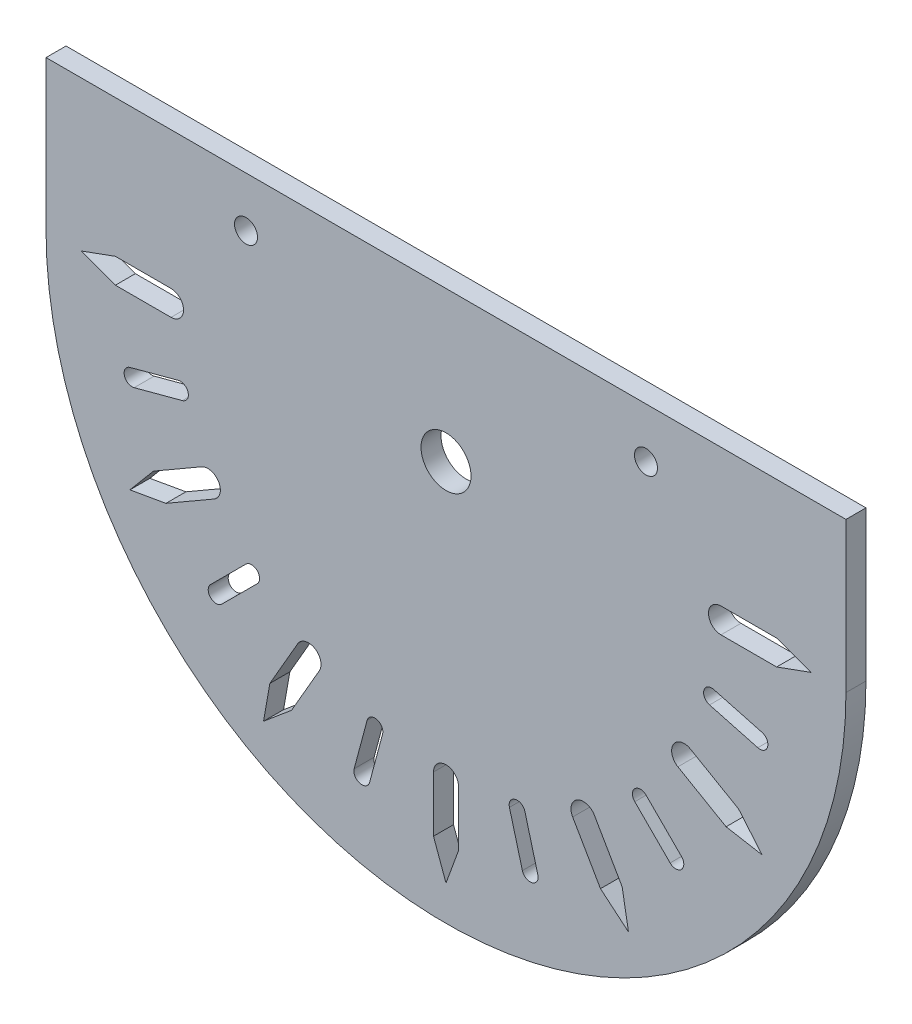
ISO-10303-21;
HEADER;
FILE_DESCRIPTION(('STEP AP214'),'2;1');
FILE_NAME('part.step','',(''),(''),'','','');
FILE_SCHEMA(('AUTOMOTIVE_DESIGN { 1 0 10303 214 1 1 1 1 }'));
ENDSEC;
DATA;
#1=APPLICATION_CONTEXT('core data for automotive mechanical design processes');
#2=APPLICATION_PROTOCOL_DEFINITION('international standard','automotive_design',2000,#1);
#3=PRODUCT_CONTEXT('',#1,'mechanical');
#4=PRODUCT('Part','Part','',(#3));
#5=PRODUCT_RELATED_PRODUCT_CATEGORY('part','',(#4));
#6=PRODUCT_DEFINITION_FORMATION('','',#4);
#7=PRODUCT_DEFINITION_CONTEXT('part definition',#1,'design');
#8=PRODUCT_DEFINITION('design','',#6,#7);
#9=PRODUCT_DEFINITION_SHAPE('','',#8);
#10=(LENGTH_UNIT() NAMED_UNIT(*) SI_UNIT(.MILLI.,.METRE.));
#11=(NAMED_UNIT(*) PLANE_ANGLE_UNIT() SI_UNIT($,.RADIAN.));
#12=(NAMED_UNIT(*) SI_UNIT($,.STERADIAN.) SOLID_ANGLE_UNIT());
#13=UNCERTAINTY_MEASURE_WITH_UNIT(LENGTH_MEASURE(1.E-05),#10,'distance_accuracy_value','');
#14=(GEOMETRIC_REPRESENTATION_CONTEXT(3) GLOBAL_UNCERTAINTY_ASSIGNED_CONTEXT((#13)) GLOBAL_UNIT_ASSIGNED_CONTEXT((#10,
#11,#12)) REPRESENTATION_CONTEXT('',''));
#15=CARTESIAN_POINT('',(0.,0.,0.));
#16=DIRECTION('',(0.,0.,1.));
#17=DIRECTION('',(1.,0.,0.));
#18=AXIS2_PLACEMENT_3D('',#15,#16,#17);
#19=CARTESIAN_POINT('',(0.,0.,2.));
#20=DIRECTION('',(0.,0.,-1.));
#21=DIRECTION('',(-1.,0.,0.));
#22=AXIS2_PLACEMENT_3D('',#19,#20,#21);
#23=CYLINDRICAL_SURFACE('',#22,40.);
#24=CARTESIAN_POINT('',(0.,0.,0.));
#25=DIRECTION('',(0.,0.,1.));
#26=DIRECTION('',(1.,0.,0.));
#27=AXIS2_PLACEMENT_3D('',#24,#25,#26);
#28=CIRCLE('',#27,40.);
#29=CARTESIAN_POINT('',(40.,0.,0.));
#30=VERTEX_POINT('',#29);
#31=CARTESIAN_POINT('',(-40.,0.,0.));
#32=VERTEX_POINT('',#31);
#33=EDGE_CURVE('E870',#30,#32,#28,.F.);
#34=ORIENTED_EDGE('',*,*,#33,.F.);
#35=DIRECTION('',(0.,0.,-1.));
#36=VECTOR('',#35,1.);
#37=CARTESIAN_POINT('',(40.,0.,2.));
#38=LINE('',#37,#36);
#39=CARTESIAN_POINT('',(40.,0.,2.));
#40=VERTEX_POINT('',#39);
#41=EDGE_CURVE('E11',#40,#30,#38,.T.);
#42=ORIENTED_EDGE('',*,*,#41,.F.);
#43=CARTESIAN_POINT('',(0.,0.,2.));
#44=DIRECTION('',(0.,0.,1.));
#45=DIRECTION('',(1.,0.,0.));
#46=AXIS2_PLACEMENT_3D('',#43,#44,#45);
#47=CIRCLE('',#46,40.);
#48=CARTESIAN_POINT('',(-40.,0.,2.));
#49=VERTEX_POINT('',#48);
#50=EDGE_CURVE('E871',#40,#49,#47,.F.);
#51=ORIENTED_EDGE('',*,*,#50,.T.);
#52=DIRECTION('',(0.,0.,-1.));
#53=VECTOR('',#52,1.);
#54=CARTESIAN_POINT('',(-40.,0.,2.));
#55=LINE('',#54,#53);
#56=EDGE_CURVE('E884',#49,#32,#55,.T.);
#57=ORIENTED_EDGE('',*,*,#56,.T.);
#58=EDGE_LOOP('',(#34,#42,#51,#57));
#59=FACE_BOUND('',#58,.T.);
#60=ADVANCED_FACE('F38',(#59),#23,.T.);
#61=CARTESIAN_POINT('',(40.,0.,2.));
#62=DIRECTION('',(1.,0.,0.));
#63=DIRECTION('',(0.,0.,-1.));
#64=AXIS2_PLACEMENT_3D('',#61,#62,#63);
#65=PLANE('',#64);
#66=DIRECTION('',(0.,-1.,0.));
#67=VECTOR('',#66,1.);
#68=CARTESIAN_POINT('',(40.,0.,0.));
#69=LINE('',#68,#67);
#70=CARTESIAN_POINT('',(40.,15.,0.));
#71=VERTEX_POINT('',#70);
#72=EDGE_CURVE('E887',#71,#30,#69,.T.);
#73=ORIENTED_EDGE('',*,*,#72,.F.);
#74=DIRECTION('',(0.,0.,-1.));
#75=VECTOR('',#74,1.);
#76=CARTESIAN_POINT('',(40.,15.,2.));
#77=LINE('',#76,#75);
#78=CARTESIAN_POINT('',(40.,15.,2.));
#79=VERTEX_POINT('',#78);
#80=EDGE_CURVE('E45',#79,#71,#77,.T.);
#81=ORIENTED_EDGE('',*,*,#80,.F.);
#82=DIRECTION('',(0.,-1.,0.));
#83=VECTOR('',#82,1.);
#84=CARTESIAN_POINT('',(40.,0.,2.));
#85=LINE('',#84,#83);
#86=EDGE_CURVE('E874',#79,#40,#85,.T.);
#87=ORIENTED_EDGE('',*,*,#86,.T.);
#88=ORIENTED_EDGE('',*,*,#41,.T.);
#89=EDGE_LOOP('',(#73,#81,#87,#88));
#90=FACE_BOUND('',#89,.T.);
#91=ADVANCED_FACE('F904',(#90),#65,.T.);
#92=CARTESIAN_POINT('',(0.,15.,2.));
#93=DIRECTION('',(0.,1.,0.));
#94=DIRECTION('',(0.,0.,1.));
#95=AXIS2_PLACEMENT_3D('',#92,#93,#94);
#96=PLANE('',#95);
#97=DIRECTION('',(1.,0.,0.));
#98=VECTOR('',#97,1.);
#99=CARTESIAN_POINT('',(0.,15.,0.));
#100=LINE('',#99,#98);
#101=CARTESIAN_POINT('',(-40.,15.,0.));
#102=VERTEX_POINT('',#101);
#103=EDGE_CURVE('E890',#102,#71,#100,.T.);
#104=ORIENTED_EDGE('',*,*,#103,.F.);
#105=DIRECTION('',(0.,0.,-1.));
#106=VECTOR('',#105,1.);
#107=CARTESIAN_POINT('',(-40.,15.,2.));
#108=LINE('',#107,#106);
#109=CARTESIAN_POINT('',(-40.,15.,2.));
#110=VERTEX_POINT('',#109);
#111=EDGE_CURVE('E896',#110,#102,#108,.T.);
#112=ORIENTED_EDGE('',*,*,#111,.F.);
#113=DIRECTION('',(1.,0.,0.));
#114=VECTOR('',#113,1.);
#115=CARTESIAN_POINT('',(0.,15.,2.));
#116=LINE('',#115,#114);
#117=EDGE_CURVE('E878',#110,#79,#116,.T.);
#118=ORIENTED_EDGE('',*,*,#117,.T.);
#119=ORIENTED_EDGE('',*,*,#80,.T.);
#120=EDGE_LOOP('',(#104,#112,#118,#119));
#121=FACE_BOUND('',#120,.T.);
#122=ADVANCED_FACE('F900',(#121),#96,.T.);
#123=CARTESIAN_POINT('',(-40.,0.,2.));
#124=DIRECTION('',(-1.,0.,0.));
#125=DIRECTION('',(0.,0.,1.));
#126=AXIS2_PLACEMENT_3D('',#123,#124,#125);
#127=PLANE('',#126);
#128=DIRECTION('',(0.,1.,0.));
#129=VECTOR('',#128,1.);
#130=CARTESIAN_POINT('',(-40.,0.,0.));
#131=LINE('',#130,#129);
#132=EDGE_CURVE('E875',#32,#102,#131,.T.);
#133=ORIENTED_EDGE('',*,*,#132,.F.);
#134=ORIENTED_EDGE('',*,*,#56,.F.);
#135=DIRECTION('',(0.,1.,0.));
#136=VECTOR('',#135,1.);
#137=CARTESIAN_POINT('',(-40.,0.,2.));
#138=LINE('',#137,#136);
#139=EDGE_CURVE('E881',#49,#110,#138,.T.);
#140=ORIENTED_EDGE('',*,*,#139,.T.);
#141=ORIENTED_EDGE('',*,*,#111,.T.);
#142=EDGE_LOOP('',(#133,#134,#140,#141));
#143=FACE_BOUND('',#142,.T.);
#144=ADVANCED_FACE('F910',(#143),#127,.T.);
#145=CARTESIAN_POINT('',(0.,0.,2.));
#146=DIRECTION('',(0.,0.,1.));
#147=DIRECTION('',(1.,0.,0.));
#148=AXIS2_PLACEMENT_3D('',#145,#146,#147);
#149=PLANE('',#148);
#150=CARTESIAN_POINT('',(-20.,10.,2.));
#151=DIRECTION('',(0.,0.,1.));
#152=DIRECTION('',(1.,0.,0.));
#153=AXIS2_PLACEMENT_3D('',#150,#151,#152);
#154=CIRCLE('',#153,1.15);
#155=CARTESIAN_POINT('',(-18.85,10.,2.));
#156=VERTEX_POINT('',#155);
#157=EDGE_CURVE('E1181',#156,#156,#154,.T.);
#158=ORIENTED_EDGE('',*,*,#157,.F.);
#159=EDGE_LOOP('',(#158));
#160=FACE_BOUND('',#159,.T.);
#161=CARTESIAN_POINT('',(20.,10.,2.));
#162=DIRECTION('',(0.,0.,1.));
#163=DIRECTION('',(-1.,0.,0.));
#164=AXIS2_PLACEMENT_3D('',#161,#162,#163);
#165=CIRCLE('',#164,1.15);
#166=CARTESIAN_POINT('',(18.85,10.,2.));
#167=VERTEX_POINT('',#166);
#168=EDGE_CURVE('E1187',#167,#167,#165,.T.);
#169=ORIENTED_EDGE('',*,*,#168,.F.);
#170=EDGE_LOOP('',(#169));
#171=FACE_BOUND('',#170,.T.);
#172=CARTESIAN_POINT('',(0.,0.,2.));
#173=DIRECTION('',(0.,0.,1.));
#174=DIRECTION('',(1.,0.,0.));
#175=AXIS2_PLACEMENT_3D('',#172,#173,#174);
#176=CIRCLE('',#175,2.5);
#177=CARTESIAN_POINT('',(2.5,0.,2.));
#178=VERTEX_POINT('',#177);
#179=EDGE_CURVE('E1184',#178,#178,#176,.T.);
#180=ORIENTED_EDGE('',*,*,#179,.F.);
#181=EDGE_LOOP('',(#180));
#182=FACE_BOUND('',#181,.T.);
#183=CARTESIAN_POINT('',(-19.4454364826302,-19.44543648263,2.));
#184=DIRECTION('',(0.,0.,1.));
#185=DIRECTION('',(0.866025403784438,0.500000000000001,0.));
#186=AXIS2_PLACEMENT_3D('',#183,#184,#185);
#187=CIRCLE('',#186,0.800000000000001);
#188=CARTESIAN_POINT('',(-18.8797510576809,-20.0111219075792,2.));
#189=VERTEX_POINT('',#188);
#190=CARTESIAN_POINT('',(-20.0111219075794,-18.8797510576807,2.));
#191=VERTEX_POINT('',#190);
#192=EDGE_CURVE('E52',#189,#191,#187,.T.);
#193=ORIENTED_EDGE('',*,*,#192,.F.);
#194=DIRECTION('',(0.707106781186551,0.707106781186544,0.));
#195=VECTOR('',#194,1.);
#196=CARTESIAN_POINT('',(-18.8797510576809,-20.0111219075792,2.));
#197=LINE('',#196,#195);
#198=CARTESIAN_POINT('',(-22.4152849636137,-23.5466558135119,2.));
#199=VERTEX_POINT('',#198);
#200=EDGE_CURVE('E455',#199,#189,#197,.T.);
#201=ORIENTED_EDGE('',*,*,#200,.F.);
#202=CARTESIAN_POINT('',(-22.9809703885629,-22.9809703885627,2.));
#203=DIRECTION('',(0.,0.,1.));
#204=DIRECTION('',(0.866025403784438,0.500000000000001,0.));
#205=AXIS2_PLACEMENT_3D('',#202,#203,#204);
#206=CIRCLE('',#205,0.800000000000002);
#207=CARTESIAN_POINT('',(-23.5466558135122,-22.4152849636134,2.));
#208=VERTEX_POINT('',#207);
#209=EDGE_CURVE('E438',#208,#199,#206,.T.);
#210=ORIENTED_EDGE('',*,*,#209,.F.);
#211=DIRECTION('',(-0.707106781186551,-0.707106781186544,0.));
#212=VECTOR('',#211,1.);
#213=CARTESIAN_POINT('',(-20.0111219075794,-18.8797510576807,2.));
#214=LINE('',#213,#212);
#215=EDGE_CURVE('E448',#191,#208,#214,.T.);
#216=ORIENTED_EDGE('',*,*,#215,.F.);
#217=EDGE_LOOP('',(#193,#201,#210,#216));
#218=FACE_BOUND('',#217,.T.);
#219=CARTESIAN_POINT('',(-7.11752374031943,-26.5629602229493,2.));
#220=DIRECTION('',(0.,0.,1.));
#221=DIRECTION('',(0.499999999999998,0.86602540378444,0.));
#222=AXIS2_PLACEMENT_3D('',#219,#220,#221);
#223=CIRCLE('',#222,0.800000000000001);
#224=CARTESIAN_POINT('',(-6.34478307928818,-26.7700154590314,2.));
#225=VERTEX_POINT('',#224);
#226=CARTESIAN_POINT('',(-7.89026440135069,-26.3559049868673,2.));
#227=VERTEX_POINT('',#226);
#228=EDGE_CURVE('E60',#225,#227,#223,.T.);
#229=ORIENTED_EDGE('',*,*,#228,.F.);
#230=DIRECTION('',(0.258819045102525,0.965925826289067,0.));
#231=VECTOR('',#230,1.);
#232=CARTESIAN_POINT('',(-6.34478307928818,-26.7700154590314,2.));
#233=LINE('',#232,#231);
#234=CARTESIAN_POINT('',(-7.6388783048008,-31.5996445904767,2.));
#235=VERTEX_POINT('',#234);
#236=EDGE_CURVE('E485',#235,#225,#233,.T.);
#237=ORIENTED_EDGE('',*,*,#236,.F.);
#238=CARTESIAN_POINT('',(-8.41161896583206,-31.3925893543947,2.));
#239=DIRECTION('',(0.,0.,1.));
#240=DIRECTION('',(0.499999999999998,0.86602540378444,0.));
#241=AXIS2_PLACEMENT_3D('',#238,#239,#240);
#242=CIRCLE('',#241,0.800000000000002);
#243=CARTESIAN_POINT('',(-9.18435962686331,-31.1855341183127,2.));
#244=VERTEX_POINT('',#243);
#245=EDGE_CURVE('E482',#244,#235,#242,.T.);
#246=ORIENTED_EDGE('',*,*,#245,.F.);
#247=DIRECTION('',(-0.258819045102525,-0.965925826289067,0.));
#248=VECTOR('',#247,1.);
#249=CARTESIAN_POINT('',(-7.89026440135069,-26.3559049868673,2.));
#250=LINE('',#249,#248);
#251=EDGE_CURVE('E478',#227,#244,#250,.T.);
#252=ORIENTED_EDGE('',*,*,#251,.F.);
#253=EDGE_LOOP('',(#229,#237,#246,#252));
#254=FACE_BOUND('',#253,.T.);
#255=CARTESIAN_POINT('',(7.11752374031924,-26.5629602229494,2.));
#256=DIRECTION('',(0.,0.,1.));
#257=DIRECTION('',(0.,1.,0.));
#258=AXIS2_PLACEMENT_3D('',#255,#256,#257);
#259=CIRCLE('',#258,0.800000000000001);
#260=CARTESIAN_POINT('',(7.8902644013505,-26.3559049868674,2.));
#261=VERTEX_POINT('',#260);
#262=CARTESIAN_POINT('',(6.34478307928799,-26.7700154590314,2.));
#263=VERTEX_POINT('',#262);
#264=EDGE_CURVE('E504',#261,#263,#259,.T.);
#265=ORIENTED_EDGE('',*,*,#264,.F.);
#266=DIRECTION('',(-0.258819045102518,0.965925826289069,0.));
#267=VECTOR('',#266,1.);
#268=CARTESIAN_POINT('',(7.8902644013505,-26.3559049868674,2.));
#269=LINE('',#268,#267);
#270=CARTESIAN_POINT('',(9.18435962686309,-31.1855341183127,2.));
#271=VERTEX_POINT('',#270);
#272=EDGE_CURVE('E513',#271,#261,#269,.T.);
#273=ORIENTED_EDGE('',*,*,#272,.F.);
#274=CARTESIAN_POINT('',(8.41161896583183,-31.3925893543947,2.));
#275=DIRECTION('',(0.,0.,1.));
#276=DIRECTION('',(0.,1.,0.));
#277=AXIS2_PLACEMENT_3D('',#274,#275,#276);
#278=CIRCLE('',#277,0.800000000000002);
#279=CARTESIAN_POINT('',(7.63887830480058,-31.5996445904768,2.));
#280=VERTEX_POINT('',#279);
#281=EDGE_CURVE('E510',#280,#271,#278,.T.);
#282=ORIENTED_EDGE('',*,*,#281,.F.);
#283=DIRECTION('',(0.258819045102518,-0.965925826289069,0.));
#284=VECTOR('',#283,1.);
#285=CARTESIAN_POINT('',(6.34478307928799,-26.7700154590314,2.));
#286=LINE('',#285,#284);
#287=EDGE_CURVE('E506',#263,#280,#286,.T.);
#288=ORIENTED_EDGE('',*,*,#287,.F.);
#289=EDGE_LOOP('',(#265,#273,#282,#288));
#290=FACE_BOUND('',#289,.T.);
#291=CARTESIAN_POINT('',(19.44543648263,-19.4454364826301,2.));
#292=DIRECTION('',(0.,0.,1.));
#293=DIRECTION('',(-0.500000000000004,0.866025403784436,0.));
#294=AXIS2_PLACEMENT_3D('',#291,#292,#293);
#295=CIRCLE('',#294,0.800000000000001);
#296=CARTESIAN_POINT('',(20.0111219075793,-18.8797510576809,2.));
#297=VERTEX_POINT('',#296);
#298=CARTESIAN_POINT('',(18.8797510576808,-20.0111219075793,2.));
#299=VERTEX_POINT('',#298);
#300=EDGE_CURVE('E533',#297,#299,#295,.T.);
#301=ORIENTED_EDGE('',*,*,#300,.F.);
#302=DIRECTION('',(-0.707106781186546,0.707106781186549,0.));
#303=VECTOR('',#302,1.);
#304=CARTESIAN_POINT('',(20.0111219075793,-18.8797510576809,2.));
#305=LINE('',#304,#303);
#306=CARTESIAN_POINT('',(23.546655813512,-22.4152849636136,2.));
#307=VERTEX_POINT('',#306);
#308=EDGE_CURVE('E542',#307,#297,#305,.T.);
#309=ORIENTED_EDGE('',*,*,#308,.F.);
#310=CARTESIAN_POINT('',(22.9809703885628,-22.9809703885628,2.));
#311=DIRECTION('',(0.,0.,1.));
#312=DIRECTION('',(-0.500000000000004,0.866025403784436,0.));
#313=AXIS2_PLACEMENT_3D('',#310,#311,#312);
#314=CIRCLE('',#313,0.800000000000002);
#315=CARTESIAN_POINT('',(22.4152849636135,-23.5466558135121,2.));
#316=VERTEX_POINT('',#315);
#317=EDGE_CURVE('E539',#316,#307,#314,.T.);
#318=ORIENTED_EDGE('',*,*,#317,.F.);
#319=DIRECTION('',(0.707106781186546,-0.707106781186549,0.));
#320=VECTOR('',#319,1.);
#321=CARTESIAN_POINT('',(18.8797510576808,-20.0111219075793,2.));
#322=LINE('',#321,#320);
#323=EDGE_CURVE('E535',#299,#316,#322,.T.);
#324=ORIENTED_EDGE('',*,*,#323,.F.);
#325=EDGE_LOOP('',(#301,#309,#318,#324));
#326=FACE_BOUND('',#325,.T.);
#327=CARTESIAN_POINT('',(26.5629602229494,-7.11752374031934,2.));
#328=DIRECTION('',(0.,0.,1.));
#329=DIRECTION('',(-0.866025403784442,0.499999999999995,0.));
#330=AXIS2_PLACEMENT_3D('',#327,#328,#329);
#331=CIRCLE('',#330,0.800000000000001);
#332=CARTESIAN_POINT('',(26.7700154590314,-6.34478307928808,2.));
#333=VERTEX_POINT('',#332);
#334=CARTESIAN_POINT('',(26.3559049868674,-7.8902644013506,2.));
#335=VERTEX_POINT('',#334);
#336=EDGE_CURVE('E562',#333,#335,#331,.T.);
#337=ORIENTED_EDGE('',*,*,#336,.F.);
#338=DIRECTION('',(-0.965925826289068,0.258819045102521,0.));
#339=VECTOR('',#338,1.);
#340=CARTESIAN_POINT('',(26.7700154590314,-6.34478307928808,2.));
#341=LINE('',#340,#339);
#342=CARTESIAN_POINT('',(31.5996445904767,-7.63887830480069,2.));
#343=VERTEX_POINT('',#342);
#344=EDGE_CURVE('E571',#343,#333,#341,.T.);
#345=ORIENTED_EDGE('',*,*,#344,.F.);
#346=CARTESIAN_POINT('',(31.3925893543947,-8.41161896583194,2.));
#347=DIRECTION('',(0.,0.,1.));
#348=DIRECTION('',(-0.866025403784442,0.499999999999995,0.));
#349=AXIS2_PLACEMENT_3D('',#346,#347,#348);
#350=CIRCLE('',#349,0.800000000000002);
#351=CARTESIAN_POINT('',(31.1855341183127,-9.1843596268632,2.));
#352=VERTEX_POINT('',#351);
#353=EDGE_CURVE('E568',#352,#343,#350,.T.);
#354=ORIENTED_EDGE('',*,*,#353,.F.);
#355=DIRECTION('',(0.965925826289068,-0.258819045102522,0.));
#356=VECTOR('',#355,1.);
#357=CARTESIAN_POINT('',(26.3559049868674,-7.8902644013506,2.));
#358=LINE('',#357,#356);
#359=EDGE_CURVE('E564',#335,#352,#358,.T.);
#360=ORIENTED_EDGE('',*,*,#359,.F.);
#361=EDGE_LOOP('',(#337,#345,#354,#360));
#362=FACE_BOUND('',#361,.T.);
#363=CARTESIAN_POINT('',(-26.5629602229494,-7.11752374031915,2.));
#364=DIRECTION('',(0.,0.,1.));
#365=DIRECTION('',(1.,0.,0.));
#366=AXIS2_PLACEMENT_3D('',#363,#364,#365);
#367=CIRCLE('',#366,0.800000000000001);
#368=CARTESIAN_POINT('',(-26.3559049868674,-7.89026440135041,2.));
#369=VERTEX_POINT('',#368);
#370=CARTESIAN_POINT('',(-26.7700154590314,-6.34478307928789,2.));
#371=VERTEX_POINT('',#370);
#372=EDGE_CURVE('E466',#369,#371,#367,.T.);
#373=ORIENTED_EDGE('',*,*,#372,.F.);
#374=DIRECTION('',(0.96592582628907,0.258819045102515,0.));
#375=VECTOR('',#374,1.);
#376=CARTESIAN_POINT('',(-26.3559049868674,-7.89026440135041,2.));
#377=LINE('',#376,#375);
#378=CARTESIAN_POINT('',(-31.1855341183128,-9.18435962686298,2.));
#379=VERTEX_POINT('',#378);
#380=EDGE_CURVE('E599',#379,#369,#377,.T.);
#381=ORIENTED_EDGE('',*,*,#380,.F.);
#382=CARTESIAN_POINT('',(-31.3925893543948,-8.41161896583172,2.));
#383=DIRECTION('',(0.,0.,1.));
#384=DIRECTION('',(1.,0.,0.));
#385=AXIS2_PLACEMENT_3D('',#382,#383,#384);
#386=CIRCLE('',#385,0.800000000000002);
#387=CARTESIAN_POINT('',(-31.5996445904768,-7.63887830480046,2.));
#388=VERTEX_POINT('',#387);
#389=EDGE_CURVE('E596',#388,#379,#386,.T.);
#390=ORIENTED_EDGE('',*,*,#389,.F.);
#391=DIRECTION('',(-0.96592582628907,-0.258819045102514,0.));
#392=VECTOR('',#391,1.);
#393=CARTESIAN_POINT('',(-26.7700154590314,-6.34478307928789,2.));
#394=LINE('',#393,#392);
#395=EDGE_CURVE('E593',#371,#388,#394,.T.);
#396=ORIENTED_EDGE('',*,*,#395,.F.);
#397=EDGE_LOOP('',(#373,#381,#390,#396));
#398=FACE_BOUND('',#397,.T.);
#399=DIRECTION('',(0.866025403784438,0.500000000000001,0.));
#400=VECTOR('',#399,1.);
#401=CARTESIAN_POINT('',(0.625000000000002,-1.08253175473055,2.));
#402=LINE('',#401,#400);
#403=CARTESIAN_POINT('',(-28.0106956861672,-17.6153583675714,2.));
#404=VERTEX_POINT('',#403);
#405=CARTESIAN_POINT('',(-23.190698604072,-14.8325317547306,2.));
#406=VERTEX_POINT('',#405);
#407=EDGE_CURVE('E624',#404,#406,#402,.T.);
#408=ORIENTED_EDGE('',*,*,#407,.F.);
#409=DIRECTION('',(0.984807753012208,0.173648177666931,0.));
#410=VECTOR('',#409,1.);
#411=CARTESIAN_POINT('',(2.1677778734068,-12.2940792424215,2.));
#412=LINE('',#411,#410);
#413=CARTESIAN_POINT('',(-31.609927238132,-18.25,2.));
#414=VERTEX_POINT('',#413);
#415=EDGE_CURVE('E636',#414,#404,#412,.T.);
#416=ORIENTED_EDGE('',*,*,#415,.F.);
#417=DIRECTION('',(0.642787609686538,0.766044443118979,0.));
#418=VECTOR('',#417,1.);
#419=CARTESIAN_POINT('',(-9.56309600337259,8.02439032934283,2.));
#420=LINE('',#419,#418);
#421=CARTESIAN_POINT('',(-29.2606956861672,-15.4502948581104,2.));
#422=VERTEX_POINT('',#421);
#423=EDGE_CURVE('E633',#414,#422,#420,.T.);
#424=ORIENTED_EDGE('',*,*,#423,.T.);
#425=DIRECTION('',(0.866025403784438,0.500000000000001,0.));
#426=VECTOR('',#425,1.);
#427=CARTESIAN_POINT('',(-0.625000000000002,1.08253175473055,2.));
#428=LINE('',#427,#426);
#429=CARTESIAN_POINT('',(-24.440698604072,-12.6674682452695,2.));
#430=VERTEX_POINT('',#429);
#431=EDGE_CURVE('E630',#422,#430,#428,.T.);
#432=ORIENTED_EDGE('',*,*,#431,.T.);
#433=CARTESIAN_POINT('',(-23.815698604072,-13.75,2.));
#434=DIRECTION('',(0.,0.,1.));
#435=DIRECTION('',(0.866025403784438,0.500000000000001,0.));
#436=AXIS2_PLACEMENT_3D('',#433,#434,#435);
#437=CIRCLE('',#436,1.25);
#438=EDGE_CURVE('E626',#406,#430,#437,.T.);
#439=ORIENTED_EDGE('',*,*,#438,.F.);
#440=EDGE_LOOP('',(#408,#416,#424,#432,#439));
#441=FACE_BOUND('',#440,.T.);
#442=DIRECTION('',(0.499999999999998,0.86602540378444,0.));
#443=VECTOR('',#442,1.);
#444=CARTESIAN_POINT('',(1.08253175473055,-0.624999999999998,2.));
#445=LINE('',#444,#443);
#446=CARTESIAN_POINT('',(-15.4502948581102,-29.2606956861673,2.));
#447=VERTEX_POINT('',#446);
#448=CARTESIAN_POINT('',(-12.6674682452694,-24.4406986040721,2.));
#449=VERTEX_POINT('',#448);
#450=EDGE_CURVE('E662',#447,#449,#445,.T.);
#451=ORIENTED_EDGE('',*,*,#450,.F.);
#452=DIRECTION('',(0.766044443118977,0.642787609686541,0.));
#453=VECTOR('',#452,1.);
#454=CARTESIAN_POINT('',(8.02439032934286,-9.56309600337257,2.));
#455=LINE('',#454,#453);
#456=CARTESIAN_POINT('',(-18.2499999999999,-31.6099272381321,2.));
#457=VERTEX_POINT('',#456);
#458=EDGE_CURVE('E674',#457,#447,#455,.T.);
#459=ORIENTED_EDGE('',*,*,#458,.F.);
#460=DIRECTION('',(0.173648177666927,0.984807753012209,0.));
#461=VECTOR('',#460,1.);
#462=CARTESIAN_POINT('',(-12.2940792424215,2.16777787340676,2.));
#463=LINE('',#462,#461);
#464=CARTESIAN_POINT('',(-17.6153583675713,-28.0106956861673,2.));
#465=VERTEX_POINT('',#464);
#466=EDGE_CURVE('E671',#457,#465,#463,.T.);
#467=ORIENTED_EDGE('',*,*,#466,.T.);
#468=DIRECTION('',(0.499999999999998,0.86602540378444,0.));
#469=VECTOR('',#468,1.);
#470=CARTESIAN_POINT('',(-1.08253175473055,0.624999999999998,2.));
#471=LINE('',#470,#469);
#472=CARTESIAN_POINT('',(-14.8325317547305,-23.1906986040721,2.));
#473=VERTEX_POINT('',#472);
#474=EDGE_CURVE('E668',#465,#473,#471,.T.);
#475=ORIENTED_EDGE('',*,*,#474,.T.);
#476=CARTESIAN_POINT('',(-13.7499999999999,-23.8156986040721,2.));
#477=DIRECTION('',(0.,0.,1.));
#478=DIRECTION('',(0.499999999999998,0.86602540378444,0.));
#479=AXIS2_PLACEMENT_3D('',#476,#477,#478);
#480=CIRCLE('',#479,1.25);
#481=EDGE_CURVE('E664',#449,#473,#480,.T.);
#482=ORIENTED_EDGE('',*,*,#481,.F.);
#483=EDGE_LOOP('',(#451,#459,#467,#475,#482));
#484=FACE_BOUND('',#483,.T.);
#485=DIRECTION('',(0.,1.,0.));
#486=VECTOR('',#485,1.);
#487=CARTESIAN_POINT('',(1.25,0.,2.));
#488=LINE('',#487,#486);
#489=CARTESIAN_POINT('',(1.25000000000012,-33.0656532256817,2.));
#490=VERTEX_POINT('',#489);
#491=CARTESIAN_POINT('',(1.2500000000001,-27.5,2.));
#492=VERTEX_POINT('',#491);
#493=EDGE_CURVE('E699',#490,#492,#488,.T.);
#494=ORIENTED_EDGE('',*,*,#493,.F.);
#495=DIRECTION('',(0.342020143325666,0.939692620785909,0.));
#496=VECTOR('',#495,1.);
#497=CARTESIAN_POINT('',(11.7308738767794,-4.26968891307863,2.));
#498=LINE('',#497,#496);
#499=CARTESIAN_POINT('',(1.30908515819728E-13,-36.5,2.));
#500=VERTEX_POINT('',#499);
#501=EDGE_CURVE('E711',#500,#490,#498,.T.);
#502=ORIENTED_EDGE('',*,*,#501,.F.);
#503=DIRECTION('',(-0.342020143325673,0.939692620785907,0.));
#504=VECTOR('',#503,1.);
#505=CARTESIAN_POINT('',(-11.7308738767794,-4.26968891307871,2.));
#506=LINE('',#505,#504);
#507=CARTESIAN_POINT('',(-1.24999999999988,-33.0656532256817,2.));
#508=VERTEX_POINT('',#507);
#509=EDGE_CURVE('E708',#500,#508,#506,.T.);
#510=ORIENTED_EDGE('',*,*,#509,.T.);
#511=DIRECTION('',(0.,1.,0.));
#512=VECTOR('',#511,1.);
#513=CARTESIAN_POINT('',(-1.25,0.,2.));
#514=LINE('',#513,#512);
#515=CARTESIAN_POINT('',(-1.2499999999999,-27.5,2.));
#516=VERTEX_POINT('',#515);
#517=EDGE_CURVE('E705',#508,#516,#514,.T.);
#518=ORIENTED_EDGE('',*,*,#517,.T.);
#519=CARTESIAN_POINT('',(0.,-27.5,2.));
#520=DIRECTION('',(0.,0.,1.));
#521=DIRECTION('',(0.,1.,0.));
#522=AXIS2_PLACEMENT_3D('',#519,#520,#521);
#523=CIRCLE('',#522,1.25);
#524=EDGE_CURVE('E701',#492,#516,#523,.T.);
#525=ORIENTED_EDGE('',*,*,#524,.F.);
#526=EDGE_LOOP('',(#494,#502,#510,#518,#525));
#527=FACE_BOUND('',#526,.T.);
#528=DIRECTION('',(-0.500000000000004,0.866025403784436,0.));
#529=VECTOR('',#528,1.);
#530=CARTESIAN_POINT('',(1.08253175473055,0.625000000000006,2.));
#531=LINE('',#530,#529);
#532=CARTESIAN_POINT('',(17.6153583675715,-28.0106956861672,2.));
#533=VERTEX_POINT('',#532);
#534=CARTESIAN_POINT('',(14.8325317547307,-23.190698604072,2.));
#535=VERTEX_POINT('',#534);
#536=EDGE_CURVE('E736',#533,#535,#531,.T.);
#537=ORIENTED_EDGE('',*,*,#536,.F.);
#538=DIRECTION('',(-0.173648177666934,0.984807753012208,0.));
#539=VECTOR('',#538,1.);
#540=CARTESIAN_POINT('',(12.2940792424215,2.16777787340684,2.));
#541=LINE('',#540,#539);
#542=CARTESIAN_POINT('',(18.2500000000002,-31.6099272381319,2.));
#543=VERTEX_POINT('',#542);
#544=EDGE_CURVE('E748',#543,#533,#541,.T.);
#545=ORIENTED_EDGE('',*,*,#544,.F.);
#546=DIRECTION('',(-0.766044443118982,0.642787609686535,0.));
#547=VECTOR('',#546,1.);
#548=CARTESIAN_POINT('',(-8.0243903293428,-9.56309600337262,2.));
#549=LINE('',#548,#547);
#550=CARTESIAN_POINT('',(15.4502948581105,-29.2606956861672,2.));
#551=VERTEX_POINT('',#550);
#552=EDGE_CURVE('E745',#543,#551,#549,.T.);
#553=ORIENTED_EDGE('',*,*,#552,.T.);
#554=DIRECTION('',(-0.500000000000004,0.866025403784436,0.));
#555=VECTOR('',#554,1.);
#556=CARTESIAN_POINT('',(-1.08253175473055,-0.625000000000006,2.));
#557=LINE('',#556,#555);
#558=CARTESIAN_POINT('',(12.6674682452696,-24.440698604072,2.));
#559=VERTEX_POINT('',#558);
#560=EDGE_CURVE('E742',#551,#559,#557,.T.);
#561=ORIENTED_EDGE('',*,*,#560,.T.);
#562=CARTESIAN_POINT('',(13.7500000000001,-23.815698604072,2.));
#563=DIRECTION('',(0.,0.,1.));
#564=DIRECTION('',(-0.500000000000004,0.866025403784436,0.));
#565=AXIS2_PLACEMENT_3D('',#562,#563,#564);
#566=CIRCLE('',#565,1.25);
#567=EDGE_CURVE('E738',#535,#559,#566,.T.);
#568=ORIENTED_EDGE('',*,*,#567,.F.);
#569=EDGE_LOOP('',(#537,#545,#553,#561,#568));
#570=FACE_BOUND('',#569,.T.);
#571=DIRECTION('',(-0.866025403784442,0.499999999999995,0.));
#572=VECTOR('',#571,1.);
#573=CARTESIAN_POINT('',(0.624999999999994,1.08253175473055,2.));
#574=LINE('',#573,#572);
#575=CARTESIAN_POINT('',(29.2606956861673,-15.4502948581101,2.));
#576=VERTEX_POINT('',#575);
#577=CARTESIAN_POINT('',(24.4406986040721,-12.6674682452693,2.));
#578=VERTEX_POINT('',#577);
#579=EDGE_CURVE('E773',#576,#578,#574,.T.);
#580=ORIENTED_EDGE('',*,*,#579,.F.);
#581=DIRECTION('',(-0.642787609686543,0.766044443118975,0.));
#582=VECTOR('',#581,1.);
#583=CARTESIAN_POINT('',(9.56309600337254,8.0243903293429,2.));
#584=LINE('',#583,#582);
#585=CARTESIAN_POINT('',(31.6099272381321,-18.2499999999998,2.));
#586=VERTEX_POINT('',#585);
#587=EDGE_CURVE('E785',#586,#576,#584,.T.);
#588=ORIENTED_EDGE('',*,*,#587,.F.);
#589=DIRECTION('',(-0.984807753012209,0.173648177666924,0.));
#590=VECTOR('',#589,1.);
#591=CARTESIAN_POINT('',(-2.16777787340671,-12.2940792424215,2.));
#592=LINE('',#591,#590);
#593=CARTESIAN_POINT('',(28.0106956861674,-17.6153583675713,2.));
#594=VERTEX_POINT('',#593);
#595=EDGE_CURVE('E782',#586,#594,#592,.T.);
#596=ORIENTED_EDGE('',*,*,#595,.T.);
#597=DIRECTION('',(-0.866025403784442,0.499999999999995,0.));
#598=VECTOR('',#597,1.);
#599=CARTESIAN_POINT('',(-0.624999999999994,-1.08253175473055,2.));
#600=LINE('',#599,#598);
#601=CARTESIAN_POINT('',(23.1906986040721,-14.8325317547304,2.));
#602=VERTEX_POINT('',#601);
#603=EDGE_CURVE('E779',#594,#602,#600,.T.);
#604=ORIENTED_EDGE('',*,*,#603,.T.);
#605=CARTESIAN_POINT('',(23.8156986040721,-13.7499999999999,2.));
#606=DIRECTION('',(0.,0.,1.));
#607=DIRECTION('',(-0.866025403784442,0.499999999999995,0.));
#608=AXIS2_PLACEMENT_3D('',#605,#606,#607);
#609=CIRCLE('',#608,1.25);
#610=EDGE_CURVE('E775',#578,#602,#609,.T.);
#611=ORIENTED_EDGE('',*,*,#610,.F.);
#612=EDGE_LOOP('',(#580,#588,#596,#604,#611));
#613=FACE_BOUND('',#612,.T.);
#614=DIRECTION('',(-1.,0.,0.));
#615=VECTOR('',#614,1.);
#616=CARTESIAN_POINT('',(0.,1.25,2.));
#617=LINE('',#616,#615);
#618=CARTESIAN_POINT('',(33.0656532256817,1.25,2.));
#619=VERTEX_POINT('',#618);
#620=CARTESIAN_POINT('',(27.5,1.25,2.));
#621=VERTEX_POINT('',#620);
#622=EDGE_CURVE('E611',#619,#621,#617,.T.);
#623=ORIENTED_EDGE('',*,*,#622,.F.);
#624=DIRECTION('',(-0.939692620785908,0.34202014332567,0.));
#625=VECTOR('',#624,1.);
#626=CARTESIAN_POINT('',(4.26968891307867,11.7308738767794,2.));
#627=LINE('',#626,#625);
#628=CARTESIAN_POINT('',(36.5,0.,2.));
#629=VERTEX_POINT('',#628);
#630=EDGE_CURVE('E820',#629,#619,#627,.T.);
#631=ORIENTED_EDGE('',*,*,#630,.F.);
#632=DIRECTION('',(-0.939692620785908,-0.34202014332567,0.));
#633=VECTOR('',#632,1.);
#634=CARTESIAN_POINT('',(4.26968891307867,-11.7308738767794,2.));
#635=LINE('',#634,#633);
#636=CARTESIAN_POINT('',(33.0656532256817,-1.25,2.));
#637=VERTEX_POINT('',#636);
#638=EDGE_CURVE('E817',#629,#637,#635,.T.);
#639=ORIENTED_EDGE('',*,*,#638,.T.);
#640=DIRECTION('',(-1.,0.,0.));
#641=VECTOR('',#640,1.);
#642=CARTESIAN_POINT('',(0.,-1.25,2.));
#643=LINE('',#642,#641);
#644=CARTESIAN_POINT('',(27.5,-1.25,2.));
#645=VERTEX_POINT('',#644);
#646=EDGE_CURVE('E814',#637,#645,#643,.T.);
#647=ORIENTED_EDGE('',*,*,#646,.T.);
#648=CARTESIAN_POINT('',(27.5,0.,2.));
#649=DIRECTION('',(0.,0.,1.));
#650=DIRECTION('',(-1.,0.,0.));
#651=AXIS2_PLACEMENT_3D('',#648,#649,#650);
#652=CIRCLE('',#651,1.25);
#653=EDGE_CURVE('E811',#621,#645,#652,.T.);
#654=ORIENTED_EDGE('',*,*,#653,.F.);
#655=EDGE_LOOP('',(#623,#631,#639,#647,#654));
#656=FACE_BOUND('',#655,.T.);
#657=DIRECTION('',(1.,0.,0.));
#658=VECTOR('',#657,1.);
#659=CARTESIAN_POINT('',(0.,-1.25,2.));
#660=LINE('',#659,#658);
#661=CARTESIAN_POINT('',(-33.0656532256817,-1.25,2.));
#662=VERTEX_POINT('',#661);
#663=CARTESIAN_POINT('',(-27.5,-1.25,2.));
#664=VERTEX_POINT('',#663);
#665=EDGE_CURVE('E650',#662,#664,#660,.T.);
#666=ORIENTED_EDGE('',*,*,#665,.F.);
#667=DIRECTION('',(0.939692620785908,-0.34202014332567,0.));
#668=VECTOR('',#667,1.);
#669=CARTESIAN_POINT('',(-4.26968891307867,-11.7308738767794,2.));
#670=LINE('',#669,#668);
#671=CARTESIAN_POINT('',(-36.5,0.,2.));
#672=VERTEX_POINT('',#671);
#673=EDGE_CURVE('E856',#672,#662,#670,.T.);
#674=ORIENTED_EDGE('',*,*,#673,.F.);
#675=DIRECTION('',(0.939692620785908,0.34202014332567,0.));
#676=VECTOR('',#675,1.);
#677=CARTESIAN_POINT('',(-4.26968891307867,11.7308738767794,2.));
#678=LINE('',#677,#676);
#679=CARTESIAN_POINT('',(-33.0656532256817,1.25,2.));
#680=VERTEX_POINT('',#679);
#681=EDGE_CURVE('E853',#672,#680,#678,.T.);
#682=ORIENTED_EDGE('',*,*,#681,.T.);
#683=DIRECTION('',(1.,0.,0.));
#684=VECTOR('',#683,1.);
#685=CARTESIAN_POINT('',(0.,1.25,2.));
#686=LINE('',#685,#684);
#687=CARTESIAN_POINT('',(-27.5,1.25,2.));
#688=VERTEX_POINT('',#687);
#689=EDGE_CURVE('E850',#680,#688,#686,.T.);
#690=ORIENTED_EDGE('',*,*,#689,.T.);
#691=CARTESIAN_POINT('',(-27.5,0.,2.));
#692=DIRECTION('',(0.,0.,1.));
#693=DIRECTION('',(1.,0.,0.));
#694=AXIS2_PLACEMENT_3D('',#691,#692,#693);
#695=CIRCLE('',#694,1.25);
#696=EDGE_CURVE('E847',#664,#688,#695,.T.);
#697=ORIENTED_EDGE('',*,*,#696,.F.);
#698=EDGE_LOOP('',(#666,#674,#682,#690,#697));
#699=FACE_BOUND('',#698,.T.);
#700=ORIENTED_EDGE('',*,*,#50,.F.);
#701=ORIENTED_EDGE('',*,*,#86,.F.);
#702=ORIENTED_EDGE('',*,*,#117,.F.);
#703=ORIENTED_EDGE('',*,*,#139,.F.);
#704=EDGE_LOOP('',(#700,#701,#702,#703));
#705=FACE_BOUND('',#704,.T.);
#706=ADVANCED_FACE('F452',(#160,#171,#182,#218,#254,#290,#326,#362,#398,#441,#484,#527,#570,
#613,#656,#699,#705),#149,.T.);
#707=CARTESIAN_POINT('',(0.,0.,0.));
#708=DIRECTION('',(0.,0.,1.));
#709=DIRECTION('',(1.,0.,0.));
#710=AXIS2_PLACEMENT_3D('',#707,#708,#709);
#711=PLANE('',#710);
#712=CARTESIAN_POINT('',(-20.,10.,0.));
#713=DIRECTION('',(0.,0.,1.));
#714=DIRECTION('',(1.,0.,0.));
#715=AXIS2_PLACEMENT_3D('',#712,#713,#714);
#716=CIRCLE('',#715,1.15);
#717=CARTESIAN_POINT('',(-18.85,10.,0.));
#718=VERTEX_POINT('',#717);
#719=EDGE_CURVE('E1178',#718,#718,#716,.F.);
#720=ORIENTED_EDGE('',*,*,#719,.F.);
#721=EDGE_LOOP('',(#720));
#722=FACE_BOUND('',#721,.T.);
#723=CARTESIAN_POINT('',(20.,10.,0.));
#724=DIRECTION('',(0.,0.,1.));
#725=DIRECTION('',(1.,0.,0.));
#726=AXIS2_PLACEMENT_3D('',#723,#724,#725);
#727=CIRCLE('',#726,1.15);
#728=CARTESIAN_POINT('',(21.15,10.,0.));
#729=VERTEX_POINT('',#728);
#730=EDGE_CURVE('E1182',#729,#729,#727,.F.);
#731=ORIENTED_EDGE('',*,*,#730,.F.);
#732=EDGE_LOOP('',(#731));
#733=FACE_BOUND('',#732,.T.);
#734=CARTESIAN_POINT('',(0.,0.,0.));
#735=DIRECTION('',(0.,0.,1.));
#736=DIRECTION('',(1.,0.,0.));
#737=AXIS2_PLACEMENT_3D('',#734,#735,#736);
#738=CIRCLE('',#737,2.5);
#739=CARTESIAN_POINT('',(2.5,0.,0.));
#740=VERTEX_POINT('',#739);
#741=EDGE_CURVE('E565',#740,#740,#738,.F.);
#742=ORIENTED_EDGE('',*,*,#741,.F.);
#743=EDGE_LOOP('',(#742));
#744=FACE_BOUND('',#743,.T.);
#745=DIRECTION('',(-0.707106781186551,-0.707106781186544,0.));
#746=VECTOR('',#745,1.);
#747=CARTESIAN_POINT('',(-18.8797510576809,-20.0111219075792,0.));
#748=LINE('',#747,#746);
#749=CARTESIAN_POINT('',(-18.8797510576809,-20.0111219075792,0.));
#750=VERTEX_POINT('',#749);
#751=CARTESIAN_POINT('',(-22.4152849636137,-23.5466558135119,0.));
#752=VERTEX_POINT('',#751);
#753=EDGE_CURVE('E1197',#750,#752,#748,.T.);
#754=ORIENTED_EDGE('',*,*,#753,.F.);
#755=CARTESIAN_POINT('',(-19.4454364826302,-19.44543648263,0.));
#756=DIRECTION('',(0.,0.,1.));
#757=DIRECTION('',(1.,0.,0.));
#758=AXIS2_PLACEMENT_3D('',#755,#756,#757);
#759=CIRCLE('',#758,0.800000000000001);
#760=CARTESIAN_POINT('',(-20.0111219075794,-18.8797510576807,0.));
#761=VERTEX_POINT('',#760);
#762=EDGE_CURVE('E467',#761,#750,#759,.F.);
#763=ORIENTED_EDGE('',*,*,#762,.F.);
#764=DIRECTION('',(0.707106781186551,0.707106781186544,0.));
#765=VECTOR('',#764,1.);
#766=CARTESIAN_POINT('',(-20.0111219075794,-18.8797510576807,0.));
#767=LINE('',#766,#765);
#768=CARTESIAN_POINT('',(-23.5466558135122,-22.4152849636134,0.));
#769=VERTEX_POINT('',#768);
#770=EDGE_CURVE('E464',#769,#761,#767,.T.);
#771=ORIENTED_EDGE('',*,*,#770,.F.);
#772=CARTESIAN_POINT('',(-22.9809703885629,-22.9809703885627,0.));
#773=DIRECTION('',(0.,0.,1.));
#774=DIRECTION('',(1.,0.,0.));
#775=AXIS2_PLACEMENT_3D('',#772,#773,#774);
#776=CIRCLE('',#775,0.800000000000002);
#777=EDGE_CURVE('E441',#752,#769,#776,.F.);
#778=ORIENTED_EDGE('',*,*,#777,.F.);
#779=EDGE_LOOP('',(#754,#763,#771,#778));
#780=FACE_BOUND('',#779,.T.);
#781=DIRECTION('',(-0.258819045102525,-0.965925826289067,0.));
#782=VECTOR('',#781,1.);
#783=CARTESIAN_POINT('',(-6.34478307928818,-26.7700154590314,0.));
#784=LINE('',#783,#782);
#785=CARTESIAN_POINT('',(-6.34478307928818,-26.7700154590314,0.));
#786=VERTEX_POINT('',#785);
#787=CARTESIAN_POINT('',(-7.6388783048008,-31.5996445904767,0.));
#788=VERTEX_POINT('',#787);
#789=EDGE_CURVE('E471',#786,#788,#784,.T.);
#790=ORIENTED_EDGE('',*,*,#789,.F.);
#791=CARTESIAN_POINT('',(-7.11752374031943,-26.5629602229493,0.));
#792=DIRECTION('',(0.,0.,1.));
#793=DIRECTION('',(1.,0.,0.));
#794=AXIS2_PLACEMENT_3D('',#791,#792,#793);
#795=CIRCLE('',#794,0.800000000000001);
#796=CARTESIAN_POINT('',(-7.89026440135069,-26.3559049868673,0.));
#797=VERTEX_POINT('',#796);
#798=EDGE_CURVE('E474',#797,#786,#795,.F.);
#799=ORIENTED_EDGE('',*,*,#798,.F.);
#800=DIRECTION('',(0.258819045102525,0.965925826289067,0.));
#801=VECTOR('',#800,1.);
#802=CARTESIAN_POINT('',(-7.89026440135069,-26.3559049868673,0.));
#803=LINE('',#802,#801);
#804=CARTESIAN_POINT('',(-9.18435962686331,-31.1855341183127,0.));
#805=VERTEX_POINT('',#804);
#806=EDGE_CURVE('E476',#805,#797,#803,.T.);
#807=ORIENTED_EDGE('',*,*,#806,.F.);
#808=CARTESIAN_POINT('',(-8.41161896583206,-31.3925893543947,0.));
#809=DIRECTION('',(0.,0.,1.));
#810=DIRECTION('',(1.,0.,0.));
#811=AXIS2_PLACEMENT_3D('',#808,#809,#810);
#812=CIRCLE('',#811,0.800000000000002);
#813=EDGE_CURVE('E468',#788,#805,#812,.F.);
#814=ORIENTED_EDGE('',*,*,#813,.F.);
#815=EDGE_LOOP('',(#790,#799,#807,#814));
#816=FACE_BOUND('',#815,.T.);
#817=DIRECTION('',(0.258819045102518,-0.965925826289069,0.));
#818=VECTOR('',#817,1.);
#819=CARTESIAN_POINT('',(7.8902644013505,-26.3559049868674,0.));
#820=LINE('',#819,#818);
#821=CARTESIAN_POINT('',(7.8902644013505,-26.3559049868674,0.));
#822=VERTEX_POINT('',#821);
#823=CARTESIAN_POINT('',(9.18435962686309,-31.1855341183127,0.));
#824=VERTEX_POINT('',#823);
#825=EDGE_CURVE('E499',#822,#824,#820,.T.);
#826=ORIENTED_EDGE('',*,*,#825,.F.);
#827=CARTESIAN_POINT('',(7.11752374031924,-26.5629602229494,0.));
#828=DIRECTION('',(0.,0.,1.));
#829=DIRECTION('',(1.,0.,0.));
#830=AXIS2_PLACEMENT_3D('',#827,#828,#829);
#831=CIRCLE('',#830,0.800000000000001);
#832=CARTESIAN_POINT('',(6.34478307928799,-26.7700154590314,0.));
#833=VERTEX_POINT('',#832);
#834=EDGE_CURVE('E502',#833,#822,#831,.F.);
#835=ORIENTED_EDGE('',*,*,#834,.F.);
#836=DIRECTION('',(-0.258819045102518,0.965925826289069,0.));
#837=VECTOR('',#836,1.);
#838=CARTESIAN_POINT('',(6.34478307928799,-26.7700154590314,0.));
#839=LINE('',#838,#837);
#840=CARTESIAN_POINT('',(7.63887830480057,-31.5996445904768,0.));
#841=VERTEX_POINT('',#840);
#842=EDGE_CURVE('E479',#841,#833,#839,.T.);
#843=ORIENTED_EDGE('',*,*,#842,.F.);
#844=CARTESIAN_POINT('',(8.41161896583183,-31.3925893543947,0.));
#845=DIRECTION('',(0.,0.,1.));
#846=DIRECTION('',(1.,0.,0.));
#847=AXIS2_PLACEMENT_3D('',#844,#845,#846);
#848=CIRCLE('',#847,0.800000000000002);
#849=EDGE_CURVE('E496',#824,#841,#848,.F.);
#850=ORIENTED_EDGE('',*,*,#849,.F.);
#851=EDGE_LOOP('',(#826,#835,#843,#850));
#852=FACE_BOUND('',#851,.T.);
#853=DIRECTION('',(0.707106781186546,-0.707106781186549,0.));
#854=VECTOR('',#853,1.);
#855=CARTESIAN_POINT('',(20.0111219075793,-18.8797510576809,0.));
#856=LINE('',#855,#854);
#857=CARTESIAN_POINT('',(20.0111219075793,-18.8797510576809,0.));
#858=VERTEX_POINT('',#857);
#859=CARTESIAN_POINT('',(23.546655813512,-22.4152849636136,0.));
#860=VERTEX_POINT('',#859);
#861=EDGE_CURVE('E528',#858,#860,#856,.T.);
#862=ORIENTED_EDGE('',*,*,#861,.F.);
#863=CARTESIAN_POINT('',(19.44543648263,-19.4454364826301,0.));
#864=DIRECTION('',(0.,0.,1.));
#865=DIRECTION('',(1.,0.,0.));
#866=AXIS2_PLACEMENT_3D('',#863,#864,#865);
#867=CIRCLE('',#866,0.800000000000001);
#868=CARTESIAN_POINT('',(18.8797510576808,-20.0111219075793,0.));
#869=VERTEX_POINT('',#868);
#870=EDGE_CURVE('E531',#869,#858,#867,.F.);
#871=ORIENTED_EDGE('',*,*,#870,.F.);
#872=DIRECTION('',(-0.707106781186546,0.707106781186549,0.));
#873=VECTOR('',#872,1.);
#874=CARTESIAN_POINT('',(18.8797510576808,-20.0111219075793,0.));
#875=LINE('',#874,#873);
#876=CARTESIAN_POINT('',(22.4152849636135,-23.5466558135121,0.));
#877=VERTEX_POINT('',#876);
#878=EDGE_CURVE('E507',#877,#869,#875,.T.);
#879=ORIENTED_EDGE('',*,*,#878,.F.);
#880=CARTESIAN_POINT('',(22.9809703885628,-22.9809703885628,0.));
#881=DIRECTION('',(0.,0.,1.));
#882=DIRECTION('',(1.,0.,0.));
#883=AXIS2_PLACEMENT_3D('',#880,#881,#882);
#884=CIRCLE('',#883,0.800000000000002);
#885=EDGE_CURVE('E525',#860,#877,#884,.F.);
#886=ORIENTED_EDGE('',*,*,#885,.F.);
#887=EDGE_LOOP('',(#862,#871,#879,#886));
#888=FACE_BOUND('',#887,.T.);
#889=DIRECTION('',(0.965925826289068,-0.258819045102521,0.));
#890=VECTOR('',#889,1.);
#891=CARTESIAN_POINT('',(26.7700154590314,-6.34478307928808,0.));
#892=LINE('',#891,#890);
#893=CARTESIAN_POINT('',(26.7700154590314,-6.34478307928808,0.));
#894=VERTEX_POINT('',#893);
#895=CARTESIAN_POINT('',(31.5996445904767,-7.63887830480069,0.));
#896=VERTEX_POINT('',#895);
#897=EDGE_CURVE('E557',#894,#896,#892,.T.);
#898=ORIENTED_EDGE('',*,*,#897,.F.);
#899=CARTESIAN_POINT('',(26.5629602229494,-7.11752374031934,0.));
#900=DIRECTION('',(0.,0.,1.));
#901=DIRECTION('',(1.,0.,0.));
#902=AXIS2_PLACEMENT_3D('',#899,#900,#901);
#903=CIRCLE('',#902,0.800000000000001);
#904=CARTESIAN_POINT('',(26.3559049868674,-7.8902644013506,0.));
#905=VERTEX_POINT('',#904);
#906=EDGE_CURVE('E560',#905,#894,#903,.F.);
#907=ORIENTED_EDGE('',*,*,#906,.F.);
#908=DIRECTION('',(-0.965925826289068,0.258819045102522,0.));
#909=VECTOR('',#908,1.);
#910=CARTESIAN_POINT('',(26.3559049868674,-7.8902644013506,0.));
#911=LINE('',#910,#909);
#912=CARTESIAN_POINT('',(31.1855341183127,-9.1843596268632,0.));
#913=VERTEX_POINT('',#912);
#914=EDGE_CURVE('E536',#913,#905,#911,.T.);
#915=ORIENTED_EDGE('',*,*,#914,.F.);
#916=CARTESIAN_POINT('',(31.3925893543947,-8.41161896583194,0.));
#917=DIRECTION('',(0.,0.,1.));
#918=DIRECTION('',(1.,0.,0.));
#919=AXIS2_PLACEMENT_3D('',#916,#917,#918);
#920=CIRCLE('',#919,0.800000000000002);
#921=EDGE_CURVE('E554',#896,#913,#920,.F.);
#922=ORIENTED_EDGE('',*,*,#921,.F.);
#923=EDGE_LOOP('',(#898,#907,#915,#922));
#924=FACE_BOUND('',#923,.T.);
#925=DIRECTION('',(-0.96592582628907,-0.258819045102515,0.));
#926=VECTOR('',#925,1.);
#927=CARTESIAN_POINT('',(-26.3559049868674,-7.89026440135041,0.));
#928=LINE('',#927,#926);
#929=CARTESIAN_POINT('',(-26.3559049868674,-7.89026440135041,0.));
#930=VERTEX_POINT('',#929);
#931=CARTESIAN_POINT('',(-31.1855341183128,-9.18435962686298,0.));
#932=VERTEX_POINT('',#931);
#933=EDGE_CURVE('E586',#930,#932,#928,.T.);
#934=ORIENTED_EDGE('',*,*,#933,.F.);
#935=CARTESIAN_POINT('',(-26.5629602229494,-7.11752374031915,0.));
#936=DIRECTION('',(0.,0.,1.));
#937=DIRECTION('',(1.,0.,0.));
#938=AXIS2_PLACEMENT_3D('',#935,#936,#937);
#939=CIRCLE('',#938,0.800000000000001);
#940=CARTESIAN_POINT('',(-26.7700154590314,-6.34478307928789,0.));
#941=VERTEX_POINT('',#940);
#942=EDGE_CURVE('E589',#941,#930,#939,.F.);
#943=ORIENTED_EDGE('',*,*,#942,.F.);
#944=DIRECTION('',(0.96592582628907,0.258819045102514,0.));
#945=VECTOR('',#944,1.);
#946=CARTESIAN_POINT('',(-26.7700154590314,-6.34478307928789,0.));
#947=LINE('',#946,#945);
#948=CARTESIAN_POINT('',(-31.5996445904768,-7.63887830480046,0.));
#949=VERTEX_POINT('',#948);
#950=EDGE_CURVE('E591',#949,#941,#947,.T.);
#951=ORIENTED_EDGE('',*,*,#950,.F.);
#952=CARTESIAN_POINT('',(-31.3925893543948,-8.41161896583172,0.));
#953=DIRECTION('',(0.,0.,1.));
#954=DIRECTION('',(1.,0.,0.));
#955=AXIS2_PLACEMENT_3D('',#952,#953,#954);
#956=CIRCLE('',#955,0.800000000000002);
#957=EDGE_CURVE('E583',#932,#949,#956,.F.);
#958=ORIENTED_EDGE('',*,*,#957,.F.);
#959=EDGE_LOOP('',(#934,#943,#951,#958));
#960=FACE_BOUND('',#959,.T.);
#961=DIRECTION('',(-0.984807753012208,-0.173648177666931,0.));
#962=VECTOR('',#961,1.);
#963=CARTESIAN_POINT('',(2.1677778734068,-12.2940792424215,0.));
#964=LINE('',#963,#962);
#965=CARTESIAN_POINT('',(-28.0106956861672,-17.6153583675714,0.));
#966=VERTEX_POINT('',#965);
#967=CARTESIAN_POINT('',(-31.609927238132,-18.25,0.));
#968=VERTEX_POINT('',#967);
#969=EDGE_CURVE('E619',#966,#968,#964,.T.);
#970=ORIENTED_EDGE('',*,*,#969,.F.);
#971=DIRECTION('',(-0.866025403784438,-0.500000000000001,0.));
#972=VECTOR('',#971,1.);
#973=CARTESIAN_POINT('',(0.625000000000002,-1.08253175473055,0.));
#974=LINE('',#973,#972);
#975=CARTESIAN_POINT('',(-23.190698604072,-14.8325317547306,0.));
#976=VERTEX_POINT('',#975);
#977=EDGE_CURVE('E621',#976,#966,#974,.T.);
#978=ORIENTED_EDGE('',*,*,#977,.F.);
#979=CARTESIAN_POINT('',(-23.815698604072,-13.75,0.));
#980=DIRECTION('',(0.,0.,1.));
#981=DIRECTION('',(1.,0.,0.));
#982=AXIS2_PLACEMENT_3D('',#979,#980,#981);
#983=CIRCLE('',#982,1.25);
#984=CARTESIAN_POINT('',(-24.440698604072,-12.6674682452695,0.));
#985=VERTEX_POINT('',#984);
#986=EDGE_CURVE('E623',#985,#976,#983,.F.);
#987=ORIENTED_EDGE('',*,*,#986,.F.);
#988=DIRECTION('',(-0.866025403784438,-0.500000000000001,0.));
#989=VECTOR('',#988,1.);
#990=CARTESIAN_POINT('',(-0.625000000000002,1.08253175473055,0.));
#991=LINE('',#990,#989);
#992=CARTESIAN_POINT('',(-29.2606956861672,-15.4502948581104,0.));
#993=VERTEX_POINT('',#992);
#994=EDGE_CURVE('E612',#985,#993,#991,.T.);
#995=ORIENTED_EDGE('',*,*,#994,.T.);
#996=DIRECTION('',(-0.642787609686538,-0.766044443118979,0.));
#997=VECTOR('',#996,1.);
#998=CARTESIAN_POINT('',(-9.56309600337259,8.02439032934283,0.));
#999=LINE('',#998,#997);
#1000=EDGE_CURVE('E615',#993,#968,#999,.T.);
#1001=ORIENTED_EDGE('',*,*,#1000,.T.);
#1002=EDGE_LOOP('',(#970,#978,#987,#995,#1001));
#1003=FACE_BOUND('',#1002,.T.);
#1004=DIRECTION('',(-0.766044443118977,-0.642787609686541,0.));
#1005=VECTOR('',#1004,1.);
#1006=CARTESIAN_POINT('',(8.02439032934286,-9.56309600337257,0.));
#1007=LINE('',#1006,#1005);
#1008=CARTESIAN_POINT('',(-15.4502948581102,-29.2606956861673,0.));
#1009=VERTEX_POINT('',#1008);
#1010=CARTESIAN_POINT('',(-18.2499999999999,-31.6099272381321,0.));
#1011=VERTEX_POINT('',#1010);
#1012=EDGE_CURVE('E658',#1009,#1011,#1007,.T.);
#1013=ORIENTED_EDGE('',*,*,#1012,.F.);
#1014=DIRECTION('',(-0.499999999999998,-0.86602540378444,0.));
#1015=VECTOR('',#1014,1.);
#1016=CARTESIAN_POINT('',(1.08253175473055,-0.624999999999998,0.));
#1017=LINE('',#1016,#1015);
#1018=CARTESIAN_POINT('',(-12.6674682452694,-24.4406986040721,0.));
#1019=VERTEX_POINT('',#1018);
#1020=EDGE_CURVE('E660',#1019,#1009,#1017,.T.);
#1021=ORIENTED_EDGE('',*,*,#1020,.F.);
#1022=CARTESIAN_POINT('',(-13.7499999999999,-23.8156986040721,0.));
#1023=DIRECTION('',(0.,0.,1.));
#1024=DIRECTION('',(1.,0.,0.));
#1025=AXIS2_PLACEMENT_3D('',#1022,#1023,#1024);
#1026=CIRCLE('',#1025,1.25);
#1027=CARTESIAN_POINT('',(-14.8325317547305,-23.1906986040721,0.));
#1028=VERTEX_POINT('',#1027);
#1029=EDGE_CURVE('E627',#1028,#1019,#1026,.F.);
#1030=ORIENTED_EDGE('',*,*,#1029,.F.);
#1031=DIRECTION('',(-0.499999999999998,-0.86602540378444,0.));
#1032=VECTOR('',#1031,1.);
#1033=CARTESIAN_POINT('',(-1.08253175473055,0.624999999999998,0.));
#1034=LINE('',#1033,#1032);
#1035=CARTESIAN_POINT('',(-17.6153583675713,-28.0106956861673,0.));
#1036=VERTEX_POINT('',#1035);
#1037=EDGE_CURVE('E651',#1028,#1036,#1034,.T.);
#1038=ORIENTED_EDGE('',*,*,#1037,.T.);
#1039=DIRECTION('',(-0.173648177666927,-0.984807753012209,0.));
#1040=VECTOR('',#1039,1.);
#1041=CARTESIAN_POINT('',(-12.2940792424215,2.16777787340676,0.));
#1042=LINE('',#1041,#1040);
#1043=EDGE_CURVE('E654',#1036,#1011,#1042,.T.);
#1044=ORIENTED_EDGE('',*,*,#1043,.T.);
#1045=EDGE_LOOP('',(#1013,#1021,#1030,#1038,#1044));
#1046=FACE_BOUND('',#1045,.T.);
#1047=DIRECTION('',(-0.342020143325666,-0.939692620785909,0.));
#1048=VECTOR('',#1047,1.);
#1049=CARTESIAN_POINT('',(11.7308738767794,-4.26968891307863,0.));
#1050=LINE('',#1049,#1048);
#1051=CARTESIAN_POINT('',(1.25000000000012,-33.0656532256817,0.));
#1052=VERTEX_POINT('',#1051);
#1053=CARTESIAN_POINT('',(1.28369537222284E-13,-36.5,0.));
#1054=VERTEX_POINT('',#1053);
#1055=EDGE_CURVE('E695',#1052,#1054,#1050,.T.);
#1056=ORIENTED_EDGE('',*,*,#1055,.F.);
#1057=DIRECTION('',(0.,-1.,0.));
#1058=VECTOR('',#1057,1.);
#1059=CARTESIAN_POINT('',(1.25,0.,0.));
#1060=LINE('',#1059,#1058);
#1061=CARTESIAN_POINT('',(1.2500000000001,-27.5,0.));
#1062=VERTEX_POINT('',#1061);
#1063=EDGE_CURVE('E697',#1062,#1052,#1060,.T.);
#1064=ORIENTED_EDGE('',*,*,#1063,.F.);
#1065=CARTESIAN_POINT('',(0.,-27.5,0.));
#1066=DIRECTION('',(0.,0.,1.));
#1067=DIRECTION('',(1.,0.,0.));
#1068=AXIS2_PLACEMENT_3D('',#1065,#1066,#1067);
#1069=CIRCLE('',#1068,1.25);
#1070=CARTESIAN_POINT('',(-1.2499999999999,-27.5,0.));
#1071=VERTEX_POINT('',#1070);
#1072=EDGE_CURVE('E665',#1071,#1062,#1069,.F.);
#1073=ORIENTED_EDGE('',*,*,#1072,.F.);
#1074=DIRECTION('',(0.,-1.,0.));
#1075=VECTOR('',#1074,1.);
#1076=CARTESIAN_POINT('',(-1.25,0.,0.));
#1077=LINE('',#1076,#1075);
#1078=CARTESIAN_POINT('',(-1.24999999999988,-33.0656532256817,0.));
#1079=VERTEX_POINT('',#1078);
#1080=EDGE_CURVE('E688',#1071,#1079,#1077,.T.);
#1081=ORIENTED_EDGE('',*,*,#1080,.T.);
#1082=DIRECTION('',(0.342020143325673,-0.939692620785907,0.));
#1083=VECTOR('',#1082,1.);
#1084=CARTESIAN_POINT('',(-11.7308738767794,-4.26968891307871,0.));
#1085=LINE('',#1084,#1083);
#1086=EDGE_CURVE('E691',#1079,#1054,#1085,.T.);
#1087=ORIENTED_EDGE('',*,*,#1086,.T.);
#1088=EDGE_LOOP('',(#1056,#1064,#1073,#1081,#1087));
#1089=FACE_BOUND('',#1088,.T.);
#1090=DIRECTION('',(0.173648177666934,-0.984807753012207,0.));
#1091=VECTOR('',#1090,1.);
#1092=CARTESIAN_POINT('',(12.2940792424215,2.16777787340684,0.));
#1093=LINE('',#1092,#1091);
#1094=CARTESIAN_POINT('',(17.6153583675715,-28.0106956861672,0.));
#1095=VERTEX_POINT('',#1094);
#1096=CARTESIAN_POINT('',(18.2500000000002,-31.6099272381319,0.));
#1097=VERTEX_POINT('',#1096);
#1098=EDGE_CURVE('E732',#1095,#1097,#1093,.T.);
#1099=ORIENTED_EDGE('',*,*,#1098,.F.);
#1100=DIRECTION('',(0.500000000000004,-0.866025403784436,0.));
#1101=VECTOR('',#1100,1.);
#1102=CARTESIAN_POINT('',(1.08253175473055,0.625000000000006,0.));
#1103=LINE('',#1102,#1101);
#1104=CARTESIAN_POINT('',(14.8325317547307,-23.190698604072,0.));
#1105=VERTEX_POINT('',#1104);
#1106=EDGE_CURVE('E734',#1105,#1095,#1103,.T.);
#1107=ORIENTED_EDGE('',*,*,#1106,.F.);
#1108=CARTESIAN_POINT('',(13.7500000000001,-23.815698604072,0.));
#1109=DIRECTION('',(0.,0.,1.));
#1110=DIRECTION('',(1.,0.,0.));
#1111=AXIS2_PLACEMENT_3D('',#1108,#1109,#1110);
#1112=CIRCLE('',#1111,1.25);
#1113=CARTESIAN_POINT('',(12.6674682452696,-24.440698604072,0.));
#1114=VERTEX_POINT('',#1113);
#1115=EDGE_CURVE('E702',#1114,#1105,#1112,.F.);
#1116=ORIENTED_EDGE('',*,*,#1115,.F.);
#1117=DIRECTION('',(0.500000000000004,-0.866025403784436,0.));
#1118=VECTOR('',#1117,1.);
#1119=CARTESIAN_POINT('',(-1.08253175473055,-0.625000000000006,0.));
#1120=LINE('',#1119,#1118);
#1121=CARTESIAN_POINT('',(15.4502948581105,-29.2606956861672,0.));
#1122=VERTEX_POINT('',#1121);
#1123=EDGE_CURVE('E725',#1114,#1122,#1120,.T.);
#1124=ORIENTED_EDGE('',*,*,#1123,.T.);
#1125=DIRECTION('',(0.766044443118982,-0.642787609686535,0.));
#1126=VECTOR('',#1125,1.);
#1127=CARTESIAN_POINT('',(-8.0243903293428,-9.56309600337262,0.));
#1128=LINE('',#1127,#1126);
#1129=EDGE_CURVE('E728',#1122,#1097,#1128,.T.);
#1130=ORIENTED_EDGE('',*,*,#1129,.T.);
#1131=EDGE_LOOP('',(#1099,#1107,#1116,#1124,#1130));
#1132=FACE_BOUND('',#1131,.T.);
#1133=DIRECTION('',(0.642787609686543,-0.766044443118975,0.));
#1134=VECTOR('',#1133,1.);
#1135=CARTESIAN_POINT('',(9.56309600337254,8.0243903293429,0.));
#1136=LINE('',#1135,#1134);
#1137=CARTESIAN_POINT('',(29.2606956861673,-15.4502948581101,0.));
#1138=VERTEX_POINT('',#1137);
#1139=CARTESIAN_POINT('',(31.6099272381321,-18.2499999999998,0.));
#1140=VERTEX_POINT('',#1139);
#1141=EDGE_CURVE('E769',#1138,#1140,#1136,.T.);
#1142=ORIENTED_EDGE('',*,*,#1141,.F.);
#1143=DIRECTION('',(0.866025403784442,-0.499999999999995,0.));
#1144=VECTOR('',#1143,1.);
#1145=CARTESIAN_POINT('',(0.624999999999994,1.08253175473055,0.));
#1146=LINE('',#1145,#1144);
#1147=CARTESIAN_POINT('',(24.4406986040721,-12.6674682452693,0.));
#1148=VERTEX_POINT('',#1147);
#1149=EDGE_CURVE('E771',#1148,#1138,#1146,.T.);
#1150=ORIENTED_EDGE('',*,*,#1149,.F.);
#1151=CARTESIAN_POINT('',(23.8156986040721,-13.7499999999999,0.));
#1152=DIRECTION('',(0.,0.,1.));
#1153=DIRECTION('',(1.,0.,0.));
#1154=AXIS2_PLACEMENT_3D('',#1151,#1152,#1153);
#1155=CIRCLE('',#1154,1.25);
#1156=CARTESIAN_POINT('',(23.1906986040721,-14.8325317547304,0.));
#1157=VERTEX_POINT('',#1156);
#1158=EDGE_CURVE('E739',#1157,#1148,#1155,.F.);
#1159=ORIENTED_EDGE('',*,*,#1158,.F.);
#1160=DIRECTION('',(0.866025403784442,-0.499999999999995,0.));
#1161=VECTOR('',#1160,1.);
#1162=CARTESIAN_POINT('',(-0.624999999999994,-1.08253175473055,0.));
#1163=LINE('',#1162,#1161);
#1164=CARTESIAN_POINT('',(28.0106956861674,-17.6153583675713,0.));
#1165=VERTEX_POINT('',#1164);
#1166=EDGE_CURVE('E762',#1157,#1165,#1163,.T.);
#1167=ORIENTED_EDGE('',*,*,#1166,.T.);
#1168=DIRECTION('',(0.984807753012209,-0.173648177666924,0.));
#1169=VECTOR('',#1168,1.);
#1170=CARTESIAN_POINT('',(-2.16777787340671,-12.2940792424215,0.));
#1171=LINE('',#1170,#1169);
#1172=EDGE_CURVE('E765',#1165,#1140,#1171,.T.);
#1173=ORIENTED_EDGE('',*,*,#1172,.T.);
#1174=EDGE_LOOP('',(#1142,#1150,#1159,#1167,#1173));
#1175=FACE_BOUND('',#1174,.T.);
#1176=DIRECTION('',(0.939692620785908,-0.34202014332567,0.));
#1177=VECTOR('',#1176,1.);
#1178=CARTESIAN_POINT('',(4.26968891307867,11.7308738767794,0.));
#1179=LINE('',#1178,#1177);
#1180=CARTESIAN_POINT('',(33.0656532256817,1.25,0.));
#1181=VERTEX_POINT('',#1180);
#1182=CARTESIAN_POINT('',(36.5,0.,0.));
#1183=VERTEX_POINT('',#1182);
#1184=EDGE_CURVE('E806',#1181,#1183,#1179,.T.);
#1185=ORIENTED_EDGE('',*,*,#1184,.F.);
#1186=DIRECTION('',(1.,0.,0.));
#1187=VECTOR('',#1186,1.);
#1188=CARTESIAN_POINT('',(0.,1.25,0.));
#1189=LINE('',#1188,#1187);
#1190=CARTESIAN_POINT('',(27.5,1.25,0.));
#1191=VERTEX_POINT('',#1190);
#1192=EDGE_CURVE('E808',#1191,#1181,#1189,.T.);
#1193=ORIENTED_EDGE('',*,*,#1192,.F.);
#1194=CARTESIAN_POINT('',(27.5,0.,0.));
#1195=DIRECTION('',(0.,0.,1.));
#1196=DIRECTION('',(1.,0.,0.));
#1197=AXIS2_PLACEMENT_3D('',#1194,#1195,#1196);
#1198=CIRCLE('',#1197,1.25);
#1199=CARTESIAN_POINT('',(27.5,-1.25,0.));
#1200=VERTEX_POINT('',#1199);
#1201=EDGE_CURVE('E776',#1200,#1191,#1198,.F.);
#1202=ORIENTED_EDGE('',*,*,#1201,.F.);
#1203=DIRECTION('',(1.,0.,0.));
#1204=VECTOR('',#1203,1.);
#1205=CARTESIAN_POINT('',(0.,-1.25,0.));
#1206=LINE('',#1205,#1204);
#1207=CARTESIAN_POINT('',(33.0656532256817,-1.25,0.));
#1208=VERTEX_POINT('',#1207);
#1209=EDGE_CURVE('E799',#1200,#1208,#1206,.T.);
#1210=ORIENTED_EDGE('',*,*,#1209,.T.);
#1211=DIRECTION('',(0.939692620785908,0.34202014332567,0.));
#1212=VECTOR('',#1211,1.);
#1213=CARTESIAN_POINT('',(4.26968891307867,-11.7308738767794,0.));
#1214=LINE('',#1213,#1212);
#1215=EDGE_CURVE('E802',#1208,#1183,#1214,.T.);
#1216=ORIENTED_EDGE('',*,*,#1215,.T.);
#1217=EDGE_LOOP('',(#1185,#1193,#1202,#1210,#1216));
#1218=FACE_BOUND('',#1217,.T.);
#1219=DIRECTION('',(-0.939692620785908,0.34202014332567,0.));
#1220=VECTOR('',#1219,1.);
#1221=CARTESIAN_POINT('',(-4.26968891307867,-11.7308738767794,0.));
#1222=LINE('',#1221,#1220);
#1223=CARTESIAN_POINT('',(-33.0656532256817,-1.25,0.));
#1224=VERTEX_POINT('',#1223);
#1225=CARTESIAN_POINT('',(-36.5,0.,0.));
#1226=VERTEX_POINT('',#1225);
#1227=EDGE_CURVE('E841',#1224,#1226,#1222,.T.);
#1228=ORIENTED_EDGE('',*,*,#1227,.F.);
#1229=DIRECTION('',(-1.,0.,0.));
#1230=VECTOR('',#1229,1.);
#1231=CARTESIAN_POINT('',(0.,-1.25,0.));
#1232=LINE('',#1231,#1230);
#1233=CARTESIAN_POINT('',(-27.5,-1.25,0.));
#1234=VERTEX_POINT('',#1233);
#1235=EDGE_CURVE('E843',#1234,#1224,#1232,.T.);
#1236=ORIENTED_EDGE('',*,*,#1235,.F.);
#1237=CARTESIAN_POINT('',(-27.5,0.,0.));
#1238=DIRECTION('',(0.,0.,1.));
#1239=DIRECTION('',(1.,0.,0.));
#1240=AXIS2_PLACEMENT_3D('',#1237,#1238,#1239);
#1241=CIRCLE('',#1240,1.25);
#1242=CARTESIAN_POINT('',(-27.5,1.25,0.));
#1243=VERTEX_POINT('',#1242);
#1244=EDGE_CURVE('E845',#1243,#1234,#1241,.F.);
#1245=ORIENTED_EDGE('',*,*,#1244,.F.);
#1246=DIRECTION('',(-1.,0.,0.));
#1247=VECTOR('',#1246,1.);
#1248=CARTESIAN_POINT('',(0.,1.25,0.));
#1249=LINE('',#1248,#1247);
#1250=CARTESIAN_POINT('',(-33.0656532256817,1.25,0.));
#1251=VERTEX_POINT('',#1250);
#1252=EDGE_CURVE('E834',#1243,#1251,#1249,.T.);
#1253=ORIENTED_EDGE('',*,*,#1252,.T.);
#1254=DIRECTION('',(-0.939692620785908,-0.34202014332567,0.));
#1255=VECTOR('',#1254,1.);
#1256=CARTESIAN_POINT('',(-4.26968891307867,11.7308738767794,0.));
#1257=LINE('',#1256,#1255);
#1258=EDGE_CURVE('E837',#1251,#1226,#1257,.T.);
#1259=ORIENTED_EDGE('',*,*,#1258,.T.);
#1260=EDGE_LOOP('',(#1228,#1236,#1245,#1253,#1259));
#1261=FACE_BOUND('',#1260,.T.);
#1262=ORIENTED_EDGE('',*,*,#33,.T.);
#1263=ORIENTED_EDGE('',*,*,#132,.T.);
#1264=ORIENTED_EDGE('',*,*,#103,.T.);
#1265=ORIENTED_EDGE('',*,*,#72,.T.);
#1266=EDGE_LOOP('',(#1262,#1263,#1264,#1265));
#1267=FACE_BOUND('',#1266,.T.);
#1268=ADVANCED_FACE('F907',(#722,#733,#744,#780,#816,#852,#888,#924,#960,#1003,#1046,#1089,
#1132,#1175,#1218,#1261,#1267),#711,.F.);
#1269=CARTESIAN_POINT('',(0.,-1.25,-10.5504739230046));
#1270=DIRECTION('',(0.,-1.,0.));
#1271=DIRECTION('',(1.,0.,0.));
#1272=AXIS2_PLACEMENT_3D('',#1269,#1270,#1271);
#1273=PLANE('',#1272);
#1274=ORIENTED_EDGE('',*,*,#1235,.T.);
#1275=DIRECTION('',(0.,0.,1.));
#1276=VECTOR('',#1275,1.);
#1277=CARTESIAN_POINT('',(-33.0656532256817,-1.25,-10.5504739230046));
#1278=LINE('',#1277,#1276);
#1279=EDGE_CURVE('E838',#1224,#662,#1278,.T.);
#1280=ORIENTED_EDGE('',*,*,#1279,.T.);
#1281=ORIENTED_EDGE('',*,*,#665,.T.);
#1282=DIRECTION('',(0.,0.,1.));
#1283=VECTOR('',#1282,1.);
#1284=CARTESIAN_POINT('',(-27.5,-1.25,-10.5504739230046));
#1285=LINE('',#1284,#1283);
#1286=EDGE_CURVE('E859',#1234,#664,#1285,.T.);
#1287=ORIENTED_EDGE('',*,*,#1286,.F.);
#1288=EDGE_LOOP('',(#1274,#1280,#1281,#1287));
#1289=FACE_BOUND('',#1288,.T.);
#1290=ADVANCED_FACE('F928',(#1289),#1273,.F.);
#1291=CARTESIAN_POINT('',(-4.26968891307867,-11.7308738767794,-10.5504739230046));
#1292=DIRECTION('',(-0.34202014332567,-0.939692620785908,0.));
#1293=DIRECTION('',(0.939692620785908,-0.34202014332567,0.));
#1294=AXIS2_PLACEMENT_3D('',#1291,#1292,#1293);
#1295=PLANE('',#1294);
#1296=ORIENTED_EDGE('',*,*,#1227,.T.);
#1297=DIRECTION('',(0.,0.,1.));
#1298=VECTOR('',#1297,1.);
#1299=CARTESIAN_POINT('',(-36.5,0.,-10.5504739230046));
#1300=LINE('',#1299,#1298);
#1301=EDGE_CURVE('E861',#1226,#672,#1300,.T.);
#1302=ORIENTED_EDGE('',*,*,#1301,.T.);
#1303=ORIENTED_EDGE('',*,*,#673,.T.);
#1304=ORIENTED_EDGE('',*,*,#1279,.F.);
#1305=EDGE_LOOP('',(#1296,#1302,#1303,#1304));
#1306=FACE_BOUND('',#1305,.T.);
#1307=ADVANCED_FACE('F935',(#1306),#1295,.F.);
#1308=CARTESIAN_POINT('',(-4.26968891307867,11.7308738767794,-10.5504739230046));
#1309=DIRECTION('',(0.34202014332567,-0.939692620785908,0.));
#1310=DIRECTION('',(0.939692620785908,0.34202014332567,0.));
#1311=AXIS2_PLACEMENT_3D('',#1308,#1309,#1310);
#1312=PLANE('',#1311);
#1313=DIRECTION('',(0.,0.,1.));
#1314=VECTOR('',#1313,1.);
#1315=CARTESIAN_POINT('',(-33.0656532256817,1.25,-10.5504739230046));
#1316=LINE('',#1315,#1314);
#1317=EDGE_CURVE('E863',#1251,#680,#1316,.T.);
#1318=ORIENTED_EDGE('',*,*,#1317,.T.);
#1319=ORIENTED_EDGE('',*,*,#681,.F.);
#1320=ORIENTED_EDGE('',*,*,#1301,.F.);
#1321=ORIENTED_EDGE('',*,*,#1258,.F.);
#1322=EDGE_LOOP('',(#1318,#1319,#1320,#1321));
#1323=FACE_BOUND('',#1322,.T.);
#1324=ADVANCED_FACE('F945',(#1323),#1312,.T.);
#1325=CARTESIAN_POINT('',(0.,1.25,-10.5504739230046));
#1326=DIRECTION('',(0.,-1.,0.));
#1327=DIRECTION('',(1.,0.,0.));
#1328=AXIS2_PLACEMENT_3D('',#1325,#1326,#1327);
#1329=PLANE('',#1328);
#1330=DIRECTION('',(0.,0.,1.));
#1331=VECTOR('',#1330,1.);
#1332=CARTESIAN_POINT('',(-27.5,1.25,-10.5504739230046));
#1333=LINE('',#1332,#1331);
#1334=EDGE_CURVE('E865',#1243,#688,#1333,.T.);
#1335=ORIENTED_EDGE('',*,*,#1334,.T.);
#1336=ORIENTED_EDGE('',*,*,#689,.F.);
#1337=ORIENTED_EDGE('',*,*,#1317,.F.);
#1338=ORIENTED_EDGE('',*,*,#1252,.F.);
#1339=EDGE_LOOP('',(#1335,#1336,#1337,#1338));
#1340=FACE_BOUND('',#1339,.T.);
#1341=ADVANCED_FACE('F941',(#1340),#1329,.T.);
#1342=CARTESIAN_POINT('',(-27.5,0.,-10.5504739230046));
#1343=DIRECTION('',(0.,0.,1.));
#1344=DIRECTION('',(1.,0.,0.));
#1345=AXIS2_PLACEMENT_3D('',#1342,#1343,#1344);
#1346=CYLINDRICAL_SURFACE('',#1345,1.25);
#1347=ORIENTED_EDGE('',*,*,#1244,.T.);
#1348=ORIENTED_EDGE('',*,*,#1286,.T.);
#1349=ORIENTED_EDGE('',*,*,#696,.T.);
#1350=ORIENTED_EDGE('',*,*,#1334,.F.);
#1351=EDGE_LOOP('',(#1347,#1348,#1349,#1350));
#1352=FACE_BOUND('',#1351,.T.);
#1353=ADVANCED_FACE('F937',(#1352),#1346,.F.);
#1354=CARTESIAN_POINT('',(0.,1.25,-10.5504739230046));
#1355=DIRECTION('',(0.,1.,0.));
#1356=DIRECTION('',(-1.,0.,0.));
#1357=AXIS2_PLACEMENT_3D('',#1354,#1355,#1356);
#1358=PLANE('',#1357);
#1359=ORIENTED_EDGE('',*,*,#1192,.T.);
#1360=DIRECTION('',(0.,0.,1.));
#1361=VECTOR('',#1360,1.);
#1362=CARTESIAN_POINT('',(33.0656532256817,1.25,-10.5504739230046));
#1363=LINE('',#1362,#1361);
#1364=EDGE_CURVE('E803',#1181,#619,#1363,.T.);
#1365=ORIENTED_EDGE('',*,*,#1364,.T.);
#1366=ORIENTED_EDGE('',*,*,#622,.T.);
#1367=DIRECTION('',(0.,0.,1.));
#1368=VECTOR('',#1367,1.);
#1369=CARTESIAN_POINT('',(27.5,1.25,-10.5504739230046));
#1370=LINE('',#1369,#1368);
#1371=EDGE_CURVE('E823',#1191,#621,#1370,.T.);
#1372=ORIENTED_EDGE('',*,*,#1371,.F.);
#1373=EDGE_LOOP('',(#1359,#1365,#1366,#1372));
#1374=FACE_BOUND('',#1373,.T.);
#1375=ADVANCED_FACE('F940',(#1374),#1358,.F.);
#1376=CARTESIAN_POINT('',(4.26968891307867,11.7308738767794,-10.5504739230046));
#1377=DIRECTION('',(0.34202014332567,0.939692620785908,0.));
#1378=DIRECTION('',(-0.939692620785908,0.34202014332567,0.));
#1379=AXIS2_PLACEMENT_3D('',#1376,#1377,#1378);
#1380=PLANE('',#1379);
#1381=ORIENTED_EDGE('',*,*,#1184,.T.);
#1382=DIRECTION('',(0.,0.,1.));
#1383=VECTOR('',#1382,1.);
#1384=CARTESIAN_POINT('',(36.5,0.,-10.5504739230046));
#1385=LINE('',#1384,#1383);
#1386=EDGE_CURVE('E825',#1183,#629,#1385,.T.);
#1387=ORIENTED_EDGE('',*,*,#1386,.T.);
#1388=ORIENTED_EDGE('',*,*,#630,.T.);
#1389=ORIENTED_EDGE('',*,*,#1364,.F.);
#1390=EDGE_LOOP('',(#1381,#1387,#1388,#1389));
#1391=FACE_BOUND('',#1390,.T.);
#1392=ADVANCED_FACE('F955',(#1391),#1380,.F.);
#1393=CARTESIAN_POINT('',(4.26968891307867,-11.7308738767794,-10.5504739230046));
#1394=DIRECTION('',(-0.34202014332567,0.939692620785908,0.));
#1395=DIRECTION('',(-0.939692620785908,-0.34202014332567,0.));
#1396=AXIS2_PLACEMENT_3D('',#1393,#1394,#1395);
#1397=PLANE('',#1396);
#1398=DIRECTION('',(0.,0.,1.));
#1399=VECTOR('',#1398,1.);
#1400=CARTESIAN_POINT('',(33.0656532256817,-1.25,-10.5504739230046));
#1401=LINE('',#1400,#1399);
#1402=EDGE_CURVE('E827',#1208,#637,#1401,.T.);
#1403=ORIENTED_EDGE('',*,*,#1402,.T.);
#1404=ORIENTED_EDGE('',*,*,#638,.F.);
#1405=ORIENTED_EDGE('',*,*,#1386,.F.);
#1406=ORIENTED_EDGE('',*,*,#1215,.F.);
#1407=EDGE_LOOP('',(#1403,#1404,#1405,#1406));
#1408=FACE_BOUND('',#1407,.T.);
#1409=ADVANCED_FACE('F965',(#1408),#1397,.T.);
#1410=CARTESIAN_POINT('',(0.,-1.25,-10.5504739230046));
#1411=DIRECTION('',(0.,1.,0.));
#1412=DIRECTION('',(-1.,0.,0.));
#1413=AXIS2_PLACEMENT_3D('',#1410,#1411,#1412);
#1414=PLANE('',#1413);
#1415=DIRECTION('',(0.,0.,1.));
#1416=VECTOR('',#1415,1.);
#1417=CARTESIAN_POINT('',(27.5,-1.25,-10.5504739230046));
#1418=LINE('',#1417,#1416);
#1419=EDGE_CURVE('E829',#1200,#645,#1418,.T.);
#1420=ORIENTED_EDGE('',*,*,#1419,.T.);
#1421=ORIENTED_EDGE('',*,*,#646,.F.);
#1422=ORIENTED_EDGE('',*,*,#1402,.F.);
#1423=ORIENTED_EDGE('',*,*,#1209,.F.);
#1424=EDGE_LOOP('',(#1420,#1421,#1422,#1423));
#1425=FACE_BOUND('',#1424,.T.);
#1426=ADVANCED_FACE('F961',(#1425),#1414,.T.);
#1427=CARTESIAN_POINT('',(27.5,0.,-10.5504739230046));
#1428=DIRECTION('',(0.,0.,1.));
#1429=DIRECTION('',(1.,0.,0.));
#1430=AXIS2_PLACEMENT_3D('',#1427,#1428,#1429);
#1431=CYLINDRICAL_SURFACE('',#1430,1.25);
#1432=ORIENTED_EDGE('',*,*,#1201,.T.);
#1433=ORIENTED_EDGE('',*,*,#1371,.T.);
#1434=ORIENTED_EDGE('',*,*,#653,.T.);
#1435=ORIENTED_EDGE('',*,*,#1419,.F.);
#1436=EDGE_LOOP('',(#1432,#1433,#1434,#1435));
#1437=FACE_BOUND('',#1436,.T.);
#1438=ADVANCED_FACE('F957',(#1437),#1431,.F.);
#1439=CARTESIAN_POINT('',(0.624999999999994,1.08253175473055,-10.7173024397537));
#1440=DIRECTION('',(0.499999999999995,0.866025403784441,0.));
#1441=DIRECTION('',(-0.866025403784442,0.499999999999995,0.));
#1442=AXIS2_PLACEMENT_3D('',#1439,#1440,#1441);
#1443=PLANE('',#1442);
#1444=ORIENTED_EDGE('',*,*,#1149,.T.);
#1445=DIRECTION('',(0.,0.,1.));
#1446=VECTOR('',#1445,1.);
#1447=CARTESIAN_POINT('',(29.2606956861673,-15.4502948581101,-10.7173024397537));
#1448=LINE('',#1447,#1446);
#1449=EDGE_CURVE('E766',#1138,#576,#1448,.T.);
#1450=ORIENTED_EDGE('',*,*,#1449,.T.);
#1451=ORIENTED_EDGE('',*,*,#579,.T.);
#1452=DIRECTION('',(0.,0.,1.));
#1453=VECTOR('',#1452,1.);
#1454=CARTESIAN_POINT('',(24.4406986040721,-12.6674682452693,-10.7173024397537));
#1455=LINE('',#1454,#1453);
#1456=EDGE_CURVE('E788',#1148,#578,#1455,.T.);
#1457=ORIENTED_EDGE('',*,*,#1456,.F.);
#1458=EDGE_LOOP('',(#1444,#1450,#1451,#1457));
#1459=FACE_BOUND('',#1458,.T.);
#1460=ADVANCED_FACE('F960',(#1459),#1443,.F.);
#1461=CARTESIAN_POINT('',(9.56309600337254,8.0243903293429,-10.7173024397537));
#1462=DIRECTION('',(0.766044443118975,0.642787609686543,0.));
#1463=DIRECTION('',(-0.642787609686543,0.766044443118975,0.));
#1464=AXIS2_PLACEMENT_3D('',#1461,#1462,#1463);
#1465=PLANE('',#1464);
#1466=ORIENTED_EDGE('',*,*,#1141,.T.);
#1467=DIRECTION('',(0.,0.,1.));
#1468=VECTOR('',#1467,1.);
#1469=CARTESIAN_POINT('',(31.6099272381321,-18.2499999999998,-10.7173024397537));
#1470=LINE('',#1469,#1468);
#1471=EDGE_CURVE('E790',#1140,#586,#1470,.T.);
#1472=ORIENTED_EDGE('',*,*,#1471,.T.);
#1473=ORIENTED_EDGE('',*,*,#587,.T.);
#1474=ORIENTED_EDGE('',*,*,#1449,.F.);
#1475=EDGE_LOOP('',(#1466,#1472,#1473,#1474));
#1476=FACE_BOUND('',#1475,.T.);
#1477=ADVANCED_FACE('F975',(#1476),#1465,.F.);
#1478=CARTESIAN_POINT('',(-2.16777787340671,-12.2940792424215,-10.7173024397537));
#1479=DIRECTION('',(0.173648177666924,0.984807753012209,0.));
#1480=DIRECTION('',(-0.984807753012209,0.173648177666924,0.));
#1481=AXIS2_PLACEMENT_3D('',#1478,#1479,#1480);
#1482=PLANE('',#1481);
#1483=DIRECTION('',(0.,0.,1.));
#1484=VECTOR('',#1483,1.);
#1485=CARTESIAN_POINT('',(28.0106956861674,-17.6153583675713,-10.7173024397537));
#1486=LINE('',#1485,#1484);
#1487=EDGE_CURVE('E792',#1165,#594,#1486,.T.);
#1488=ORIENTED_EDGE('',*,*,#1487,.T.);
#1489=ORIENTED_EDGE('',*,*,#595,.F.);
#1490=ORIENTED_EDGE('',*,*,#1471,.F.);
#1491=ORIENTED_EDGE('',*,*,#1172,.F.);
#1492=EDGE_LOOP('',(#1488,#1489,#1490,#1491));
#1493=FACE_BOUND('',#1492,.T.);
#1494=ADVANCED_FACE('F985',(#1493),#1482,.T.);
#1495=CARTESIAN_POINT('',(-0.624999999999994,-1.08253175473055,-10.7173024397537));
#1496=DIRECTION('',(0.499999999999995,0.866025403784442,0.));
#1497=DIRECTION('',(-0.866025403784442,0.499999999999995,0.));
#1498=AXIS2_PLACEMENT_3D('',#1495,#1496,#1497);
#1499=PLANE('',#1498);
#1500=DIRECTION('',(0.,0.,1.));
#1501=VECTOR('',#1500,1.);
#1502=CARTESIAN_POINT('',(23.1906986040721,-14.8325317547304,-10.7173024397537));
#1503=LINE('',#1502,#1501);
#1504=EDGE_CURVE('E794',#1157,#602,#1503,.T.);
#1505=ORIENTED_EDGE('',*,*,#1504,.T.);
#1506=ORIENTED_EDGE('',*,*,#603,.F.);
#1507=ORIENTED_EDGE('',*,*,#1487,.F.);
#1508=ORIENTED_EDGE('',*,*,#1166,.F.);
#1509=EDGE_LOOP('',(#1505,#1506,#1507,#1508));
#1510=FACE_BOUND('',#1509,.T.);
#1511=ADVANCED_FACE('F981',(#1510),#1499,.T.);
#1512=CARTESIAN_POINT('',(23.8156986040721,-13.7499999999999,-10.7173024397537));
#1513=DIRECTION('',(0.,0.,1.));
#1514=DIRECTION('',(1.,0.,0.));
#1515=AXIS2_PLACEMENT_3D('',#1512,#1513,#1514);
#1516=CYLINDRICAL_SURFACE('',#1515,1.25);
#1517=ORIENTED_EDGE('',*,*,#1158,.T.);
#1518=ORIENTED_EDGE('',*,*,#1456,.T.);
#1519=ORIENTED_EDGE('',*,*,#610,.T.);
#1520=ORIENTED_EDGE('',*,*,#1504,.F.);
#1521=EDGE_LOOP('',(#1517,#1518,#1519,#1520));
#1522=FACE_BOUND('',#1521,.T.);
#1523=ADVANCED_FACE('F977',(#1522),#1516,.F.);
#1524=CARTESIAN_POINT('',(1.08253175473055,0.625000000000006,-10.7173024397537));
#1525=DIRECTION('',(0.866025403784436,0.500000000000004,0.));
#1526=DIRECTION('',(-0.500000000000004,0.866025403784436,0.));
#1527=AXIS2_PLACEMENT_3D('',#1524,#1525,#1526);
#1528=PLANE('',#1527);
#1529=ORIENTED_EDGE('',*,*,#1106,.T.);
#1530=DIRECTION('',(0.,0.,1.));
#1531=VECTOR('',#1530,1.);
#1532=CARTESIAN_POINT('',(17.6153583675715,-28.0106956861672,-10.7173024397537));
#1533=LINE('',#1532,#1531);
#1534=EDGE_CURVE('E729',#1095,#533,#1533,.T.);
#1535=ORIENTED_EDGE('',*,*,#1534,.T.);
#1536=ORIENTED_EDGE('',*,*,#536,.T.);
#1537=DIRECTION('',(0.,0.,1.));
#1538=VECTOR('',#1537,1.);
#1539=CARTESIAN_POINT('',(14.8325317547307,-23.190698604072,-10.7173024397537));
#1540=LINE('',#1539,#1538);
#1541=EDGE_CURVE('E751',#1105,#535,#1540,.T.);
#1542=ORIENTED_EDGE('',*,*,#1541,.F.);
#1543=EDGE_LOOP('',(#1529,#1535,#1536,#1542));
#1544=FACE_BOUND('',#1543,.T.);
#1545=ADVANCED_FACE('F980',(#1544),#1528,.F.);
#1546=CARTESIAN_POINT('',(12.2940792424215,2.16777787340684,-10.7173024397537));
#1547=DIRECTION('',(0.984807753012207,0.173648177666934,0.));
#1548=DIRECTION('',(-0.173648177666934,0.984807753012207,0.));
#1549=AXIS2_PLACEMENT_3D('',#1546,#1547,#1548);
#1550=PLANE('',#1549);
#1551=ORIENTED_EDGE('',*,*,#1098,.T.);
#1552=DIRECTION('',(0.,0.,1.));
#1553=VECTOR('',#1552,1.);
#1554=CARTESIAN_POINT('',(18.2500000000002,-31.6099272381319,-10.7173024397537));
#1555=LINE('',#1554,#1553);
#1556=EDGE_CURVE('E753',#1097,#543,#1555,.T.);
#1557=ORIENTED_EDGE('',*,*,#1556,.T.);
#1558=ORIENTED_EDGE('',*,*,#544,.T.);
#1559=ORIENTED_EDGE('',*,*,#1534,.F.);
#1560=EDGE_LOOP('',(#1551,#1557,#1558,#1559));
#1561=FACE_BOUND('',#1560,.T.);
#1562=ADVANCED_FACE('F995',(#1561),#1550,.F.);
#1563=CARTESIAN_POINT('',(-8.0243903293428,-9.56309600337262,-10.7173024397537));
#1564=DIRECTION('',(0.642787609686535,0.766044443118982,0.));
#1565=DIRECTION('',(-0.766044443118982,0.642787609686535,0.));
#1566=AXIS2_PLACEMENT_3D('',#1563,#1564,#1565);
#1567=PLANE('',#1566);
#1568=DIRECTION('',(0.,0.,1.));
#1569=VECTOR('',#1568,1.);
#1570=CARTESIAN_POINT('',(15.4502948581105,-29.2606956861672,-10.7173024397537));
#1571=LINE('',#1570,#1569);
#1572=EDGE_CURVE('E755',#1122,#551,#1571,.T.);
#1573=ORIENTED_EDGE('',*,*,#1572,.T.);
#1574=ORIENTED_EDGE('',*,*,#552,.F.);
#1575=ORIENTED_EDGE('',*,*,#1556,.F.);
#1576=ORIENTED_EDGE('',*,*,#1129,.F.);
#1577=EDGE_LOOP('',(#1573,#1574,#1575,#1576));
#1578=FACE_BOUND('',#1577,.T.);
#1579=ADVANCED_FACE('F1005',(#1578),#1567,.T.);
#1580=CARTESIAN_POINT('',(-1.08253175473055,-0.625000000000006,-10.7173024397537));
#1581=DIRECTION('',(0.866025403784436,0.500000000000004,0.));
#1582=DIRECTION('',(-0.500000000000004,0.866025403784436,0.));
#1583=AXIS2_PLACEMENT_3D('',#1580,#1581,#1582);
#1584=PLANE('',#1583);
#1585=DIRECTION('',(0.,0.,1.));
#1586=VECTOR('',#1585,1.);
#1587=CARTESIAN_POINT('',(12.6674682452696,-24.440698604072,-10.7173024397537));
#1588=LINE('',#1587,#1586);
#1589=EDGE_CURVE('E757',#1114,#559,#1588,.T.);
#1590=ORIENTED_EDGE('',*,*,#1589,.T.);
#1591=ORIENTED_EDGE('',*,*,#560,.F.);
#1592=ORIENTED_EDGE('',*,*,#1572,.F.);
#1593=ORIENTED_EDGE('',*,*,#1123,.F.);
#1594=EDGE_LOOP('',(#1590,#1591,#1592,#1593));
#1595=FACE_BOUND('',#1594,.T.);
#1596=ADVANCED_FACE('F1001',(#1595),#1584,.T.);
#1597=CARTESIAN_POINT('',(13.7500000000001,-23.815698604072,-10.7173024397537));
#1598=DIRECTION('',(0.,0.,1.));
#1599=DIRECTION('',(1.,0.,0.));
#1600=AXIS2_PLACEMENT_3D('',#1597,#1598,#1599);
#1601=CYLINDRICAL_SURFACE('',#1600,1.25);
#1602=ORIENTED_EDGE('',*,*,#1115,.T.);
#1603=ORIENTED_EDGE('',*,*,#1541,.T.);
#1604=ORIENTED_EDGE('',*,*,#567,.T.);
#1605=ORIENTED_EDGE('',*,*,#1589,.F.);
#1606=EDGE_LOOP('',(#1602,#1603,#1604,#1605));
#1607=FACE_BOUND('',#1606,.T.);
#1608=ADVANCED_FACE('F997',(#1607),#1601,.F.);
#1609=CARTESIAN_POINT('',(1.25,0.,-10.5504739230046));
#1610=DIRECTION('',(1.,0.,0.));
#1611=DIRECTION('',(0.,1.,0.));
#1612=AXIS2_PLACEMENT_3D('',#1609,#1610,#1611);
#1613=PLANE('',#1612);
#1614=ORIENTED_EDGE('',*,*,#1063,.T.);
#1615=DIRECTION('',(0.,0.,1.));
#1616=VECTOR('',#1615,1.);
#1617=CARTESIAN_POINT('',(1.25000000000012,-33.0656532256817,-10.5504739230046));
#1618=LINE('',#1617,#1616);
#1619=EDGE_CURVE('E692',#1052,#490,#1618,.T.);
#1620=ORIENTED_EDGE('',*,*,#1619,.T.);
#1621=ORIENTED_EDGE('',*,*,#493,.T.);
#1622=DIRECTION('',(0.,0.,1.));
#1623=VECTOR('',#1622,1.);
#1624=CARTESIAN_POINT('',(1.2500000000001,-27.5,-10.5504739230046));
#1625=LINE('',#1624,#1623);
#1626=EDGE_CURVE('E714',#1062,#492,#1625,.T.);
#1627=ORIENTED_EDGE('',*,*,#1626,.F.);
#1628=EDGE_LOOP('',(#1614,#1620,#1621,#1627));
#1629=FACE_BOUND('',#1628,.T.);
#1630=ADVANCED_FACE('F1000',(#1629),#1613,.F.);
#1631=CARTESIAN_POINT('',(11.7308738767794,-4.26968891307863,-10.5504739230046));
#1632=DIRECTION('',(0.939692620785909,-0.342020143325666,0.));
#1633=DIRECTION('',(0.342020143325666,0.939692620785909,0.));
#1634=AXIS2_PLACEMENT_3D('',#1631,#1632,#1633);
#1635=PLANE('',#1634);
#1636=ORIENTED_EDGE('',*,*,#1055,.T.);
#1637=DIRECTION('',(0.,0.,1.));
#1638=VECTOR('',#1637,1.);
#1639=CARTESIAN_POINT('',(1.30908515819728E-13,-36.5,-10.5504739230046));
#1640=LINE('',#1639,#1638);
#1641=EDGE_CURVE('E716',#1054,#500,#1640,.T.);
#1642=ORIENTED_EDGE('',*,*,#1641,.T.);
#1643=ORIENTED_EDGE('',*,*,#501,.T.);
#1644=ORIENTED_EDGE('',*,*,#1619,.F.);
#1645=EDGE_LOOP('',(#1636,#1642,#1643,#1644));
#1646=FACE_BOUND('',#1645,.T.);
#1647=ADVANCED_FACE('F1015',(#1646),#1635,.F.);
#1648=CARTESIAN_POINT('',(-11.7308738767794,-4.26968891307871,-10.5504739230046));
#1649=DIRECTION('',(0.939692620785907,0.342020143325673,0.));
#1650=DIRECTION('',(-0.342020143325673,0.939692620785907,0.));
#1651=AXIS2_PLACEMENT_3D('',#1648,#1649,#1650);
#1652=PLANE('',#1651);
#1653=DIRECTION('',(0.,0.,1.));
#1654=VECTOR('',#1653,1.);
#1655=CARTESIAN_POINT('',(-1.24999999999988,-33.0656532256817,-10.5504739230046));
#1656=LINE('',#1655,#1654);
#1657=EDGE_CURVE('E718',#1079,#508,#1656,.T.);
#1658=ORIENTED_EDGE('',*,*,#1657,.T.);
#1659=ORIENTED_EDGE('',*,*,#509,.F.);
#1660=ORIENTED_EDGE('',*,*,#1641,.F.);
#1661=ORIENTED_EDGE('',*,*,#1086,.F.);
#1662=EDGE_LOOP('',(#1658,#1659,#1660,#1661));
#1663=FACE_BOUND('',#1662,.T.);
#1664=ADVANCED_FACE('F1025',(#1663),#1652,.T.);
#1665=CARTESIAN_POINT('',(-1.25,0.,-10.5504739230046));
#1666=DIRECTION('',(1.,0.,0.));
#1667=DIRECTION('',(0.,1.,0.));
#1668=AXIS2_PLACEMENT_3D('',#1665,#1666,#1667);
#1669=PLANE('',#1668);
#1670=DIRECTION('',(0.,0.,1.));
#1671=VECTOR('',#1670,1.);
#1672=CARTESIAN_POINT('',(-1.2499999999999,-27.5,-10.5504739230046));
#1673=LINE('',#1672,#1671);
#1674=EDGE_CURVE('E720',#1071,#516,#1673,.T.);
#1675=ORIENTED_EDGE('',*,*,#1674,.T.);
#1676=ORIENTED_EDGE('',*,*,#517,.F.);
#1677=ORIENTED_EDGE('',*,*,#1657,.F.);
#1678=ORIENTED_EDGE('',*,*,#1080,.F.);
#1679=EDGE_LOOP('',(#1675,#1676,#1677,#1678));
#1680=FACE_BOUND('',#1679,.T.);
#1681=ADVANCED_FACE('F1021',(#1680),#1669,.T.);
#1682=CARTESIAN_POINT('',(0.,-27.5,-10.5504739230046));
#1683=DIRECTION('',(0.,0.,1.));
#1684=DIRECTION('',(1.,0.,0.));
#1685=AXIS2_PLACEMENT_3D('',#1682,#1683,#1684);
#1686=CYLINDRICAL_SURFACE('',#1685,1.25);
#1687=ORIENTED_EDGE('',*,*,#1072,.T.);
#1688=ORIENTED_EDGE('',*,*,#1626,.T.);
#1689=ORIENTED_EDGE('',*,*,#524,.T.);
#1690=ORIENTED_EDGE('',*,*,#1674,.F.);
#1691=EDGE_LOOP('',(#1687,#1688,#1689,#1690));
#1692=FACE_BOUND('',#1691,.T.);
#1693=ADVANCED_FACE('F1017',(#1692),#1686,.F.);
#1694=CARTESIAN_POINT('',(1.08253175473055,-0.624999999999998,-10.7173024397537));
#1695=DIRECTION('',(0.86602540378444,-0.499999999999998,0.));
#1696=DIRECTION('',(0.499999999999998,0.86602540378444,0.));
#1697=AXIS2_PLACEMENT_3D('',#1694,#1695,#1696);
#1698=PLANE('',#1697);
#1699=ORIENTED_EDGE('',*,*,#1020,.T.);
#1700=DIRECTION('',(0.,0.,1.));
#1701=VECTOR('',#1700,1.);
#1702=CARTESIAN_POINT('',(-15.4502948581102,-29.2606956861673,-10.7173024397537));
#1703=LINE('',#1702,#1701);
#1704=EDGE_CURVE('E655',#1009,#447,#1703,.T.);
#1705=ORIENTED_EDGE('',*,*,#1704,.T.);
#1706=ORIENTED_EDGE('',*,*,#450,.T.);
#1707=DIRECTION('',(0.,0.,1.));
#1708=VECTOR('',#1707,1.);
#1709=CARTESIAN_POINT('',(-12.6674682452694,-24.4406986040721,-10.7173024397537));
#1710=LINE('',#1709,#1708);
#1711=EDGE_CURVE('E677',#1019,#449,#1710,.T.);
#1712=ORIENTED_EDGE('',*,*,#1711,.F.);
#1713=EDGE_LOOP('',(#1699,#1705,#1706,#1712));
#1714=FACE_BOUND('',#1713,.T.);
#1715=ADVANCED_FACE('F1020',(#1714),#1698,.F.);
#1716=CARTESIAN_POINT('',(8.02439032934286,-9.56309600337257,-10.7173024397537));
#1717=DIRECTION('',(0.64278760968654,-0.766044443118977,0.));
#1718=DIRECTION('',(0.766044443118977,0.642787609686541,0.));
#1719=AXIS2_PLACEMENT_3D('',#1716,#1717,#1718);
#1720=PLANE('',#1719);
#1721=ORIENTED_EDGE('',*,*,#1012,.T.);
#1722=DIRECTION('',(0.,0.,1.));
#1723=VECTOR('',#1722,1.);
#1724=CARTESIAN_POINT('',(-18.2499999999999,-31.6099272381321,-10.7173024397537));
#1725=LINE('',#1724,#1723);
#1726=EDGE_CURVE('E679',#1011,#457,#1725,.T.);
#1727=ORIENTED_EDGE('',*,*,#1726,.T.);
#1728=ORIENTED_EDGE('',*,*,#458,.T.);
#1729=ORIENTED_EDGE('',*,*,#1704,.F.);
#1730=EDGE_LOOP('',(#1721,#1727,#1728,#1729));
#1731=FACE_BOUND('',#1730,.T.);
#1732=ADVANCED_FACE('F1035',(#1731),#1720,.F.);
#1733=CARTESIAN_POINT('',(-12.2940792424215,2.16777787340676,-10.7173024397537));
#1734=DIRECTION('',(0.984807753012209,-0.173648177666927,0.));
#1735=DIRECTION('',(0.173648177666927,0.984807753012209,0.));
#1736=AXIS2_PLACEMENT_3D('',#1733,#1734,#1735);
#1737=PLANE('',#1736);
#1738=DIRECTION('',(0.,0.,1.));
#1739=VECTOR('',#1738,1.);
#1740=CARTESIAN_POINT('',(-17.6153583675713,-28.0106956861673,-10.7173024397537));
#1741=LINE('',#1740,#1739);
#1742=EDGE_CURVE('E681',#1036,#465,#1741,.T.);
#1743=ORIENTED_EDGE('',*,*,#1742,.T.);
#1744=ORIENTED_EDGE('',*,*,#466,.F.);
#1745=ORIENTED_EDGE('',*,*,#1726,.F.);
#1746=ORIENTED_EDGE('',*,*,#1043,.F.);
#1747=EDGE_LOOP('',(#1743,#1744,#1745,#1746));
#1748=FACE_BOUND('',#1747,.T.);
#1749=ADVANCED_FACE('F1045',(#1748),#1737,.T.);
#1750=CARTESIAN_POINT('',(-1.08253175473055,0.624999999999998,-10.7173024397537));
#1751=DIRECTION('',(0.86602540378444,-0.499999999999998,0.));
#1752=DIRECTION('',(0.499999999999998,0.86602540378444,0.));
#1753=AXIS2_PLACEMENT_3D('',#1750,#1751,#1752);
#1754=PLANE('',#1753);
#1755=DIRECTION('',(0.,0.,1.));
#1756=VECTOR('',#1755,1.);
#1757=CARTESIAN_POINT('',(-14.8325317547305,-23.1906986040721,-10.7173024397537));
#1758=LINE('',#1757,#1756);
#1759=EDGE_CURVE('E683',#1028,#473,#1758,.T.);
#1760=ORIENTED_EDGE('',*,*,#1759,.T.);
#1761=ORIENTED_EDGE('',*,*,#474,.F.);
#1762=ORIENTED_EDGE('',*,*,#1742,.F.);
#1763=ORIENTED_EDGE('',*,*,#1037,.F.);
#1764=EDGE_LOOP('',(#1760,#1761,#1762,#1763));
#1765=FACE_BOUND('',#1764,.T.);
#1766=ADVANCED_FACE('F1041',(#1765),#1754,.T.);
#1767=CARTESIAN_POINT('',(-13.7499999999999,-23.8156986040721,-10.7173024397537));
#1768=DIRECTION('',(0.,0.,1.));
#1769=DIRECTION('',(1.,0.,0.));
#1770=AXIS2_PLACEMENT_3D('',#1767,#1768,#1769);
#1771=CYLINDRICAL_SURFACE('',#1770,1.25);
#1772=ORIENTED_EDGE('',*,*,#1029,.T.);
#1773=ORIENTED_EDGE('',*,*,#1711,.T.);
#1774=ORIENTED_EDGE('',*,*,#481,.T.);
#1775=ORIENTED_EDGE('',*,*,#1759,.F.);
#1776=EDGE_LOOP('',(#1772,#1773,#1774,#1775));
#1777=FACE_BOUND('',#1776,.T.);
#1778=ADVANCED_FACE('F1037',(#1777),#1771,.F.);
#1779=CARTESIAN_POINT('',(0.625000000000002,-1.08253175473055,-10.7173024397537));
#1780=DIRECTION('',(0.500000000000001,-0.866025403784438,0.));
#1781=DIRECTION('',(0.866025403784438,0.500000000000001,0.));
#1782=AXIS2_PLACEMENT_3D('',#1779,#1780,#1781);
#1783=PLANE('',#1782);
#1784=ORIENTED_EDGE('',*,*,#977,.T.);
#1785=DIRECTION('',(0.,0.,1.));
#1786=VECTOR('',#1785,1.);
#1787=CARTESIAN_POINT('',(-28.0106956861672,-17.6153583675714,-10.7173024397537));
#1788=LINE('',#1787,#1786);
#1789=EDGE_CURVE('E616',#966,#404,#1788,.T.);
#1790=ORIENTED_EDGE('',*,*,#1789,.T.);
#1791=ORIENTED_EDGE('',*,*,#407,.T.);
#1792=DIRECTION('',(0.,0.,1.));
#1793=VECTOR('',#1792,1.);
#1794=CARTESIAN_POINT('',(-23.190698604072,-14.8325317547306,-10.7173024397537));
#1795=LINE('',#1794,#1793);
#1796=EDGE_CURVE('E639',#976,#406,#1795,.T.);
#1797=ORIENTED_EDGE('',*,*,#1796,.F.);
#1798=EDGE_LOOP('',(#1784,#1790,#1791,#1797));
#1799=FACE_BOUND('',#1798,.T.);
#1800=ADVANCED_FACE('F1040',(#1799),#1783,.F.);
#1801=CARTESIAN_POINT('',(2.1677778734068,-12.2940792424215,-10.7173024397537));
#1802=DIRECTION('',(0.173648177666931,-0.984807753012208,0.));
#1803=DIRECTION('',(0.984807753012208,0.173648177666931,0.));
#1804=AXIS2_PLACEMENT_3D('',#1801,#1802,#1803);
#1805=PLANE('',#1804);
#1806=ORIENTED_EDGE('',*,*,#969,.T.);
#1807=DIRECTION('',(0.,0.,1.));
#1808=VECTOR('',#1807,1.);
#1809=CARTESIAN_POINT('',(-31.609927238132,-18.25,-10.7173024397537));
#1810=LINE('',#1809,#1808);
#1811=EDGE_CURVE('E641',#968,#414,#1810,.T.);
#1812=ORIENTED_EDGE('',*,*,#1811,.T.);
#1813=ORIENTED_EDGE('',*,*,#415,.T.);
#1814=ORIENTED_EDGE('',*,*,#1789,.F.);
#1815=EDGE_LOOP('',(#1806,#1812,#1813,#1814));
#1816=FACE_BOUND('',#1815,.T.);
#1817=ADVANCED_FACE('F1055',(#1816),#1805,.F.);
#1818=CARTESIAN_POINT('',(-9.56309600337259,8.02439032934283,-10.7173024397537));
#1819=DIRECTION('',(0.766044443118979,-0.642787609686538,0.));
#1820=DIRECTION('',(0.642787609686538,0.766044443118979,0.));
#1821=AXIS2_PLACEMENT_3D('',#1818,#1819,#1820);
#1822=PLANE('',#1821);
#1823=DIRECTION('',(0.,0.,1.));
#1824=VECTOR('',#1823,1.);
#1825=CARTESIAN_POINT('',(-29.2606956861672,-15.4502948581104,-10.7173024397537));
#1826=LINE('',#1825,#1824);
#1827=EDGE_CURVE('E643',#993,#422,#1826,.T.);
#1828=ORIENTED_EDGE('',*,*,#1827,.T.);
#1829=ORIENTED_EDGE('',*,*,#423,.F.);
#1830=ORIENTED_EDGE('',*,*,#1811,.F.);
#1831=ORIENTED_EDGE('',*,*,#1000,.F.);
#1832=EDGE_LOOP('',(#1828,#1829,#1830,#1831));
#1833=FACE_BOUND('',#1832,.T.);
#1834=ADVANCED_FACE('F1065',(#1833),#1822,.T.);
#1835=CARTESIAN_POINT('',(-0.625000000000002,1.08253175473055,-10.7173024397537));
#1836=DIRECTION('',(0.500000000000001,-0.866025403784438,0.));
#1837=DIRECTION('',(0.866025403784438,0.500000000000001,0.));
#1838=AXIS2_PLACEMENT_3D('',#1835,#1836,#1837);
#1839=PLANE('',#1838);
#1840=DIRECTION('',(0.,0.,1.));
#1841=VECTOR('',#1840,1.);
#1842=CARTESIAN_POINT('',(-24.440698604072,-12.6674682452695,-10.7173024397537));
#1843=LINE('',#1842,#1841);
#1844=EDGE_CURVE('E645',#985,#430,#1843,.T.);
#1845=ORIENTED_EDGE('',*,*,#1844,.T.);
#1846=ORIENTED_EDGE('',*,*,#431,.F.);
#1847=ORIENTED_EDGE('',*,*,#1827,.F.);
#1848=ORIENTED_EDGE('',*,*,#994,.F.);
#1849=EDGE_LOOP('',(#1845,#1846,#1847,#1848));
#1850=FACE_BOUND('',#1849,.T.);
#1851=ADVANCED_FACE('F1061',(#1850),#1839,.T.);
#1852=CARTESIAN_POINT('',(-23.815698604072,-13.75,-10.7173024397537));
#1853=DIRECTION('',(0.,0.,1.));
#1854=DIRECTION('',(1.,0.,0.));
#1855=AXIS2_PLACEMENT_3D('',#1852,#1853,#1854);
#1856=CYLINDRICAL_SURFACE('',#1855,1.25);
#1857=ORIENTED_EDGE('',*,*,#986,.T.);
#1858=ORIENTED_EDGE('',*,*,#1796,.T.);
#1859=ORIENTED_EDGE('',*,*,#438,.T.);
#1860=ORIENTED_EDGE('',*,*,#1844,.F.);
#1861=EDGE_LOOP('',(#1857,#1858,#1859,#1860));
#1862=FACE_BOUND('',#1861,.T.);
#1863=ADVANCED_FACE('F1057',(#1862),#1856,.F.);
#1864=CARTESIAN_POINT('',(-26.5629602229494,-7.11752374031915,-7.05095156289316));
#1865=DIRECTION('',(0.,0.,1.));
#1866=DIRECTION('',(1.,0.,0.));
#1867=AXIS2_PLACEMENT_3D('',#1864,#1865,#1866);
#1868=CYLINDRICAL_SURFACE('',#1867,0.800000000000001);
#1869=ORIENTED_EDGE('',*,*,#942,.T.);
#1870=DIRECTION('',(0.,0.,1.));
#1871=VECTOR('',#1870,1.);
#1872=CARTESIAN_POINT('',(-26.3559049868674,-7.89026440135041,-7.05095156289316));
#1873=LINE('',#1872,#1871);
#1874=EDGE_CURVE('E587',#930,#369,#1873,.T.);
#1875=ORIENTED_EDGE('',*,*,#1874,.T.);
#1876=ORIENTED_EDGE('',*,*,#372,.T.);
#1877=DIRECTION('',(0.,0.,1.));
#1878=VECTOR('',#1877,1.);
#1879=CARTESIAN_POINT('',(-26.7700154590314,-6.34478307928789,-7.05095156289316));
#1880=LINE('',#1879,#1878);
#1881=EDGE_CURVE('E602',#941,#371,#1880,.T.);
#1882=ORIENTED_EDGE('',*,*,#1881,.F.);
#1883=EDGE_LOOP('',(#1869,#1875,#1876,#1882));
#1884=FACE_BOUND('',#1883,.T.);
#1885=ADVANCED_FACE('F1060',(#1884),#1868,.F.);
#1886=CARTESIAN_POINT('',(-26.3559049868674,-7.89026440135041,-7.05095156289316));
#1887=DIRECTION('',(0.258819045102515,-0.96592582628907,0.));
#1888=DIRECTION('',(0.96592582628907,0.258819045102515,0.));
#1889=AXIS2_PLACEMENT_3D('',#1886,#1887,#1888);
#1890=PLANE('',#1889);
#1891=ORIENTED_EDGE('',*,*,#933,.T.);
#1892=DIRECTION('',(0.,0.,1.));
#1893=VECTOR('',#1892,1.);
#1894=CARTESIAN_POINT('',(-31.1855341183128,-9.18435962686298,-7.05095156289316));
#1895=LINE('',#1894,#1893);
#1896=EDGE_CURVE('E604',#932,#379,#1895,.T.);
#1897=ORIENTED_EDGE('',*,*,#1896,.T.);
#1898=ORIENTED_EDGE('',*,*,#380,.T.);
#1899=ORIENTED_EDGE('',*,*,#1874,.F.);
#1900=EDGE_LOOP('',(#1891,#1897,#1898,#1899));
#1901=FACE_BOUND('',#1900,.T.);
#1902=ADVANCED_FACE('F1075',(#1901),#1890,.F.);
#1903=CARTESIAN_POINT('',(-31.3925893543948,-8.41161896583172,-7.05095156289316));
#1904=DIRECTION('',(0.,0.,1.));
#1905=DIRECTION('',(1.,0.,0.));
#1906=AXIS2_PLACEMENT_3D('',#1903,#1904,#1905);
#1907=CYLINDRICAL_SURFACE('',#1906,0.800000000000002);
#1908=ORIENTED_EDGE('',*,*,#957,.T.);
#1909=DIRECTION('',(0.,0.,1.));
#1910=VECTOR('',#1909,1.);
#1911=CARTESIAN_POINT('',(-31.5996445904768,-7.63887830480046,-7.05095156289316));
#1912=LINE('',#1911,#1910);
#1913=EDGE_CURVE('E606',#949,#388,#1912,.T.);
#1914=ORIENTED_EDGE('',*,*,#1913,.T.);
#1915=ORIENTED_EDGE('',*,*,#389,.T.);
#1916=ORIENTED_EDGE('',*,*,#1896,.F.);
#1917=EDGE_LOOP('',(#1908,#1914,#1915,#1916));
#1918=FACE_BOUND('',#1917,.T.);
#1919=ADVANCED_FACE('F1081',(#1918),#1907,.F.);
#1920=CARTESIAN_POINT('',(-26.7700154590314,-6.34478307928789,-7.05095156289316));
#1921=DIRECTION('',(-0.258819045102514,0.96592582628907,0.));
#1922=DIRECTION('',(-0.96592582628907,-0.258819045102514,0.));
#1923=AXIS2_PLACEMENT_3D('',#1920,#1921,#1922);
#1924=PLANE('',#1923);
#1925=ORIENTED_EDGE('',*,*,#950,.T.);
#1926=ORIENTED_EDGE('',*,*,#1881,.T.);
#1927=ORIENTED_EDGE('',*,*,#395,.T.);
#1928=ORIENTED_EDGE('',*,*,#1913,.F.);
#1929=EDGE_LOOP('',(#1925,#1926,#1927,#1928));
#1930=FACE_BOUND('',#1929,.T.);
#1931=ADVANCED_FACE('F1077',(#1930),#1924,.F.);
#1932=CARTESIAN_POINT('',(26.5629602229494,-7.11752374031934,-7.05095156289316));
#1933=DIRECTION('',(0.,0.,1.));
#1934=DIRECTION('',(1.,0.,0.));
#1935=AXIS2_PLACEMENT_3D('',#1932,#1933,#1934);
#1936=CYLINDRICAL_SURFACE('',#1935,0.800000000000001);
#1937=ORIENTED_EDGE('',*,*,#906,.T.);
#1938=DIRECTION('',(0.,0.,1.));
#1939=VECTOR('',#1938,1.);
#1940=CARTESIAN_POINT('',(26.7700154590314,-6.34478307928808,-7.05095156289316));
#1941=LINE('',#1940,#1939);
#1942=EDGE_CURVE('E558',#894,#333,#1941,.T.);
#1943=ORIENTED_EDGE('',*,*,#1942,.T.);
#1944=ORIENTED_EDGE('',*,*,#336,.T.);
#1945=DIRECTION('',(0.,0.,1.));
#1946=VECTOR('',#1945,1.);
#1947=CARTESIAN_POINT('',(26.3559049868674,-7.8902644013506,-7.05095156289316));
#1948=LINE('',#1947,#1946);
#1949=EDGE_CURVE('E574',#905,#335,#1948,.T.);
#1950=ORIENTED_EDGE('',*,*,#1949,.F.);
#1951=EDGE_LOOP('',(#1937,#1943,#1944,#1950));
#1952=FACE_BOUND('',#1951,.T.);
#1953=ADVANCED_FACE('F1080',(#1952),#1936,.F.);
#1954=CARTESIAN_POINT('',(26.7700154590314,-6.34478307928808,-7.05095156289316));
#1955=DIRECTION('',(0.258819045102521,0.965925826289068,0.));
#1956=DIRECTION('',(-0.965925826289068,0.258819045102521,0.));
#1957=AXIS2_PLACEMENT_3D('',#1954,#1955,#1956);
#1958=PLANE('',#1957);
#1959=ORIENTED_EDGE('',*,*,#897,.T.);
#1960=DIRECTION('',(0.,0.,1.));
#1961=VECTOR('',#1960,1.);
#1962=CARTESIAN_POINT('',(31.5996445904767,-7.63887830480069,-7.05095156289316));
#1963=LINE('',#1962,#1961);
#1964=EDGE_CURVE('E576',#896,#343,#1963,.T.);
#1965=ORIENTED_EDGE('',*,*,#1964,.T.);
#1966=ORIENTED_EDGE('',*,*,#344,.T.);
#1967=ORIENTED_EDGE('',*,*,#1942,.F.);
#1968=EDGE_LOOP('',(#1959,#1965,#1966,#1967));
#1969=FACE_BOUND('',#1968,.T.);
#1970=ADVANCED_FACE('F1091',(#1969),#1958,.F.);
#1971=CARTESIAN_POINT('',(31.3925893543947,-8.41161896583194,-7.05095156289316));
#1972=DIRECTION('',(0.,0.,1.));
#1973=DIRECTION('',(1.,0.,0.));
#1974=AXIS2_PLACEMENT_3D('',#1971,#1972,#1973);
#1975=CYLINDRICAL_SURFACE('',#1974,0.800000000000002);
#1976=ORIENTED_EDGE('',*,*,#921,.T.);
#1977=DIRECTION('',(0.,0.,1.));
#1978=VECTOR('',#1977,1.);
#1979=CARTESIAN_POINT('',(31.1855341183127,-9.1843596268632,-7.05095156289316));
#1980=LINE('',#1979,#1978);
#1981=EDGE_CURVE('E578',#913,#352,#1980,.T.);
#1982=ORIENTED_EDGE('',*,*,#1981,.T.);
#1983=ORIENTED_EDGE('',*,*,#353,.T.);
#1984=ORIENTED_EDGE('',*,*,#1964,.F.);
#1985=EDGE_LOOP('',(#1976,#1982,#1983,#1984));
#1986=FACE_BOUND('',#1985,.T.);
#1987=ADVANCED_FACE('F1097',(#1986),#1975,.F.);
#1988=CARTESIAN_POINT('',(26.3559049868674,-7.8902644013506,-7.05095156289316));
#1989=DIRECTION('',(-0.258819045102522,-0.965925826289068,0.));
#1990=DIRECTION('',(0.965925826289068,-0.258819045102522,0.));
#1991=AXIS2_PLACEMENT_3D('',#1988,#1989,#1990);
#1992=PLANE('',#1991);
#1993=ORIENTED_EDGE('',*,*,#914,.T.);
#1994=ORIENTED_EDGE('',*,*,#1949,.T.);
#1995=ORIENTED_EDGE('',*,*,#359,.T.);
#1996=ORIENTED_EDGE('',*,*,#1981,.F.);
#1997=EDGE_LOOP('',(#1993,#1994,#1995,#1996));
#1998=FACE_BOUND('',#1997,.T.);
#1999=ADVANCED_FACE('F1093',(#1998),#1992,.F.);
#2000=CARTESIAN_POINT('',(19.44543648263,-19.4454364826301,-7.26274169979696));
#2001=DIRECTION('',(0.,0.,1.));
#2002=DIRECTION('',(1.,0.,0.));
#2003=AXIS2_PLACEMENT_3D('',#2000,#2001,#2002);
#2004=CYLINDRICAL_SURFACE('',#2003,0.800000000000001);
#2005=ORIENTED_EDGE('',*,*,#870,.T.);
#2006=DIRECTION('',(0.,0.,1.));
#2007=VECTOR('',#2006,1.);
#2008=CARTESIAN_POINT('',(20.0111219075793,-18.8797510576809,-7.26274169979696));
#2009=LINE('',#2008,#2007);
#2010=EDGE_CURVE('E529',#858,#297,#2009,.T.);
#2011=ORIENTED_EDGE('',*,*,#2010,.T.);
#2012=ORIENTED_EDGE('',*,*,#300,.T.);
#2013=DIRECTION('',(0.,0.,1.));
#2014=VECTOR('',#2013,1.);
#2015=CARTESIAN_POINT('',(18.8797510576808,-20.0111219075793,-7.26274169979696));
#2016=LINE('',#2015,#2014);
#2017=EDGE_CURVE('E545',#869,#299,#2016,.T.);
#2018=ORIENTED_EDGE('',*,*,#2017,.F.);
#2019=EDGE_LOOP('',(#2005,#2011,#2012,#2018));
#2020=FACE_BOUND('',#2019,.T.);
#2021=ADVANCED_FACE('F1096',(#2020),#2004,.F.);
#2022=CARTESIAN_POINT('',(20.0111219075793,-18.8797510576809,-7.26274169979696));
#2023=DIRECTION('',(0.707106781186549,0.707106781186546,0.));
#2024=DIRECTION('',(-0.707106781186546,0.707106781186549,0.));
#2025=AXIS2_PLACEMENT_3D('',#2022,#2023,#2024);
#2026=PLANE('',#2025);
#2027=ORIENTED_EDGE('',*,*,#861,.T.);
#2028=DIRECTION('',(0.,0.,1.));
#2029=VECTOR('',#2028,1.);
#2030=CARTESIAN_POINT('',(23.546655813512,-22.4152849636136,-7.26274169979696));
#2031=LINE('',#2030,#2029);
#2032=EDGE_CURVE('E547',#860,#307,#2031,.T.);
#2033=ORIENTED_EDGE('',*,*,#2032,.T.);
#2034=ORIENTED_EDGE('',*,*,#308,.T.);
#2035=ORIENTED_EDGE('',*,*,#2010,.F.);
#2036=EDGE_LOOP('',(#2027,#2033,#2034,#2035));
#2037=FACE_BOUND('',#2036,.T.);
#2038=ADVANCED_FACE('F1107',(#2037),#2026,.F.);
#2039=CARTESIAN_POINT('',(22.9809703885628,-22.9809703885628,-7.26274169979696));
#2040=DIRECTION('',(0.,0.,1.));
#2041=DIRECTION('',(1.,0.,0.));
#2042=AXIS2_PLACEMENT_3D('',#2039,#2040,#2041);
#2043=CYLINDRICAL_SURFACE('',#2042,0.800000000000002);
#2044=ORIENTED_EDGE('',*,*,#885,.T.);
#2045=DIRECTION('',(0.,0.,1.));
#2046=VECTOR('',#2045,1.);
#2047=CARTESIAN_POINT('',(22.4152849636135,-23.5466558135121,-7.26274169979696));
#2048=LINE('',#2047,#2046);
#2049=EDGE_CURVE('E549',#877,#316,#2048,.T.);
#2050=ORIENTED_EDGE('',*,*,#2049,.T.);
#2051=ORIENTED_EDGE('',*,*,#317,.T.);
#2052=ORIENTED_EDGE('',*,*,#2032,.F.);
#2053=EDGE_LOOP('',(#2044,#2050,#2051,#2052));
#2054=FACE_BOUND('',#2053,.T.);
#2055=ADVANCED_FACE('F1113',(#2054),#2043,.F.);
#2056=CARTESIAN_POINT('',(18.8797510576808,-20.0111219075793,-7.26274169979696));
#2057=DIRECTION('',(-0.707106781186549,-0.707106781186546,0.));
#2058=DIRECTION('',(0.707106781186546,-0.707106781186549,0.));
#2059=AXIS2_PLACEMENT_3D('',#2056,#2057,#2058);
#2060=PLANE('',#2059);
#2061=ORIENTED_EDGE('',*,*,#878,.T.);
#2062=ORIENTED_EDGE('',*,*,#2017,.T.);
#2063=ORIENTED_EDGE('',*,*,#323,.T.);
#2064=ORIENTED_EDGE('',*,*,#2049,.F.);
#2065=EDGE_LOOP('',(#2061,#2062,#2063,#2064));
#2066=FACE_BOUND('',#2065,.T.);
#2067=ADVANCED_FACE('F1109',(#2066),#2060,.F.);
#2068=CARTESIAN_POINT('',(7.11752374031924,-26.5629602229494,-7.05095156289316));
#2069=DIRECTION('',(0.,0.,1.));
#2070=DIRECTION('',(1.,0.,0.));
#2071=AXIS2_PLACEMENT_3D('',#2068,#2069,#2070);
#2072=CYLINDRICAL_SURFACE('',#2071,0.800000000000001);
#2073=ORIENTED_EDGE('',*,*,#834,.T.);
#2074=DIRECTION('',(0.,0.,1.));
#2075=VECTOR('',#2074,1.);
#2076=CARTESIAN_POINT('',(7.8902644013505,-26.3559049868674,-7.05095156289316));
#2077=LINE('',#2076,#2075);
#2078=EDGE_CURVE('E500',#822,#261,#2077,.T.);
#2079=ORIENTED_EDGE('',*,*,#2078,.T.);
#2080=ORIENTED_EDGE('',*,*,#264,.T.);
#2081=DIRECTION('',(0.,0.,1.));
#2082=VECTOR('',#2081,1.);
#2083=CARTESIAN_POINT('',(6.34478307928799,-26.7700154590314,-7.05095156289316));
#2084=LINE('',#2083,#2082);
#2085=EDGE_CURVE('E516',#833,#263,#2084,.T.);
#2086=ORIENTED_EDGE('',*,*,#2085,.F.);
#2087=EDGE_LOOP('',(#2073,#2079,#2080,#2086));
#2088=FACE_BOUND('',#2087,.T.);
#2089=ADVANCED_FACE('F1112',(#2088),#2072,.F.);
#2090=CARTESIAN_POINT('',(7.8902644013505,-26.3559049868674,-7.05095156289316));
#2091=DIRECTION('',(0.965925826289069,0.258819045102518,0.));
#2092=DIRECTION('',(-0.258819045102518,0.965925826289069,0.));
#2093=AXIS2_PLACEMENT_3D('',#2090,#2091,#2092);
#2094=PLANE('',#2093);
#2095=ORIENTED_EDGE('',*,*,#825,.T.);
#2096=DIRECTION('',(0.,0.,1.));
#2097=VECTOR('',#2096,1.);
#2098=CARTESIAN_POINT('',(9.18435962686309,-31.1855341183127,-7.05095156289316));
#2099=LINE('',#2098,#2097);
#2100=EDGE_CURVE('E518',#824,#271,#2099,.T.);
#2101=ORIENTED_EDGE('',*,*,#2100,.T.);
#2102=ORIENTED_EDGE('',*,*,#272,.T.);
#2103=ORIENTED_EDGE('',*,*,#2078,.F.);
#2104=EDGE_LOOP('',(#2095,#2101,#2102,#2103));
#2105=FACE_BOUND('',#2104,.T.);
#2106=ADVANCED_FACE('F1123',(#2105),#2094,.F.);
#2107=CARTESIAN_POINT('',(8.41161896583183,-31.3925893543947,-7.05095156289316));
#2108=DIRECTION('',(0.,0.,1.));
#2109=DIRECTION('',(1.,0.,0.));
#2110=AXIS2_PLACEMENT_3D('',#2107,#2108,#2109);
#2111=CYLINDRICAL_SURFACE('',#2110,0.800000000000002);
#2112=ORIENTED_EDGE('',*,*,#849,.T.);
#2113=DIRECTION('',(0.,0.,1.));
#2114=VECTOR('',#2113,1.);
#2115=CARTESIAN_POINT('',(7.63887830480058,-31.5996445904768,-7.05095156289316));
#2116=LINE('',#2115,#2114);
#2117=EDGE_CURVE('E520',#841,#280,#2116,.T.);
#2118=ORIENTED_EDGE('',*,*,#2117,.T.);
#2119=ORIENTED_EDGE('',*,*,#281,.T.);
#2120=ORIENTED_EDGE('',*,*,#2100,.F.);
#2121=EDGE_LOOP('',(#2112,#2118,#2119,#2120));
#2122=FACE_BOUND('',#2121,.T.);
#2123=ADVANCED_FACE('F1129',(#2122),#2111,.F.);
#2124=CARTESIAN_POINT('',(6.34478307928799,-26.7700154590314,-7.05095156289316));
#2125=DIRECTION('',(-0.965925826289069,-0.258819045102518,0.));
#2126=DIRECTION('',(0.258819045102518,-0.965925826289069,0.));
#2127=AXIS2_PLACEMENT_3D('',#2124,#2125,#2126);
#2128=PLANE('',#2127);
#2129=ORIENTED_EDGE('',*,*,#842,.T.);
#2130=ORIENTED_EDGE('',*,*,#2085,.T.);
#2131=ORIENTED_EDGE('',*,*,#287,.T.);
#2132=ORIENTED_EDGE('',*,*,#2117,.F.);
#2133=EDGE_LOOP('',(#2129,#2130,#2131,#2132));
#2134=FACE_BOUND('',#2133,.T.);
#2135=ADVANCED_FACE('F1125',(#2134),#2128,.F.);
#2136=CARTESIAN_POINT('',(-7.11752374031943,-26.5629602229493,-7.05095156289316));
#2137=DIRECTION('',(0.,0.,1.));
#2138=DIRECTION('',(1.,0.,0.));
#2139=AXIS2_PLACEMENT_3D('',#2136,#2137,#2138);
#2140=CYLINDRICAL_SURFACE('',#2139,0.800000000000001);
#2141=ORIENTED_EDGE('',*,*,#798,.T.);
#2142=DIRECTION('',(0.,0.,1.));
#2143=VECTOR('',#2142,1.);
#2144=CARTESIAN_POINT('',(-6.34478307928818,-26.7700154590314,-7.05095156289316));
#2145=LINE('',#2144,#2143);
#2146=EDGE_CURVE('E472',#786,#225,#2145,.T.);
#2147=ORIENTED_EDGE('',*,*,#2146,.T.);
#2148=ORIENTED_EDGE('',*,*,#228,.T.);
#2149=DIRECTION('',(0.,0.,1.));
#2150=VECTOR('',#2149,1.);
#2151=CARTESIAN_POINT('',(-7.89026440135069,-26.3559049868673,-7.05095156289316));
#2152=LINE('',#2151,#2150);
#2153=EDGE_CURVE('E488',#797,#227,#2152,.T.);
#2154=ORIENTED_EDGE('',*,*,#2153,.F.);
#2155=EDGE_LOOP('',(#2141,#2147,#2148,#2154));
#2156=FACE_BOUND('',#2155,.T.);
#2157=ADVANCED_FACE('F1128',(#2156),#2140,.F.);
#2158=CARTESIAN_POINT('',(-6.34478307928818,-26.7700154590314,-7.05095156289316));
#2159=DIRECTION('',(0.965925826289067,-0.258819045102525,0.));
#2160=DIRECTION('',(0.258819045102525,0.965925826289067,0.));
#2161=AXIS2_PLACEMENT_3D('',#2158,#2159,#2160);
#2162=PLANE('',#2161);
#2163=ORIENTED_EDGE('',*,*,#789,.T.);
#2164=DIRECTION('',(0.,0.,1.));
#2165=VECTOR('',#2164,1.);
#2166=CARTESIAN_POINT('',(-7.6388783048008,-31.5996445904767,-7.05095156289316));
#2167=LINE('',#2166,#2165);
#2168=EDGE_CURVE('E490',#788,#235,#2167,.T.);
#2169=ORIENTED_EDGE('',*,*,#2168,.T.);
#2170=ORIENTED_EDGE('',*,*,#236,.T.);
#2171=ORIENTED_EDGE('',*,*,#2146,.F.);
#2172=EDGE_LOOP('',(#2163,#2169,#2170,#2171));
#2173=FACE_BOUND('',#2172,.T.);
#2174=ADVANCED_FACE('F1139',(#2173),#2162,.F.);
#2175=CARTESIAN_POINT('',(-8.41161896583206,-31.3925893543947,-7.05095156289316));
#2176=DIRECTION('',(0.,0.,1.));
#2177=DIRECTION('',(1.,0.,0.));
#2178=AXIS2_PLACEMENT_3D('',#2175,#2176,#2177);
#2179=CYLINDRICAL_SURFACE('',#2178,0.800000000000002);
#2180=ORIENTED_EDGE('',*,*,#813,.T.);
#2181=DIRECTION('',(0.,0.,1.));
#2182=VECTOR('',#2181,1.);
#2183=CARTESIAN_POINT('',(-9.18435962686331,-31.1855341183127,-7.05095156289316));
#2184=LINE('',#2183,#2182);
#2185=EDGE_CURVE('E492',#805,#244,#2184,.T.);
#2186=ORIENTED_EDGE('',*,*,#2185,.T.);
#2187=ORIENTED_EDGE('',*,*,#245,.T.);
#2188=ORIENTED_EDGE('',*,*,#2168,.F.);
#2189=EDGE_LOOP('',(#2180,#2186,#2187,#2188));
#2190=FACE_BOUND('',#2189,.T.);
#2191=ADVANCED_FACE('F1144',(#2190),#2179,.F.);
#2192=CARTESIAN_POINT('',(-7.89026440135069,-26.3559049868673,-7.05095156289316));
#2193=DIRECTION('',(-0.965925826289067,0.258819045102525,0.));
#2194=DIRECTION('',(-0.258819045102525,-0.965925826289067,0.));
#2195=AXIS2_PLACEMENT_3D('',#2192,#2193,#2194);
#2196=PLANE('',#2195);
#2197=ORIENTED_EDGE('',*,*,#806,.T.);
#2198=ORIENTED_EDGE('',*,*,#2153,.T.);
#2199=ORIENTED_EDGE('',*,*,#251,.T.);
#2200=ORIENTED_EDGE('',*,*,#2185,.F.);
#2201=EDGE_LOOP('',(#2197,#2198,#2199,#2200));
#2202=FACE_BOUND('',#2201,.T.);
#2203=ADVANCED_FACE('F1140',(#2202),#2196,.F.);
#2204=CARTESIAN_POINT('',(-19.4454364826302,-19.44543648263,-7.26274169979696));
#2205=DIRECTION('',(0.,0.,1.));
#2206=DIRECTION('',(1.,0.,0.));
#2207=AXIS2_PLACEMENT_3D('',#2204,#2205,#2206);
#2208=CYLINDRICAL_SURFACE('',#2207,0.800000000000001);
#2209=ORIENTED_EDGE('',*,*,#762,.T.);
#2210=DIRECTION('',(0.,0.,1.));
#2211=VECTOR('',#2210,1.);
#2212=CARTESIAN_POINT('',(-18.8797510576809,-20.0111219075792,-7.26274169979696));
#2213=LINE('',#2212,#2211);
#2214=EDGE_CURVE('E460',#750,#189,#2213,.T.);
#2215=ORIENTED_EDGE('',*,*,#2214,.T.);
#2216=ORIENTED_EDGE('',*,*,#192,.T.);
#2217=DIRECTION('',(0.,0.,1.));
#2218=VECTOR('',#2217,1.);
#2219=CARTESIAN_POINT('',(-20.0111219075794,-18.8797510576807,-7.26274169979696));
#2220=LINE('',#2219,#2218);
#2221=EDGE_CURVE('E445',#761,#191,#2220,.T.);
#2222=ORIENTED_EDGE('',*,*,#2221,.F.);
#2223=EDGE_LOOP('',(#2209,#2215,#2216,#2222));
#2224=FACE_BOUND('',#2223,.T.);
#2225=ADVANCED_FACE('F1143',(#2224),#2208,.F.);
#2226=CARTESIAN_POINT('',(-18.8797510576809,-20.0111219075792,-7.26274169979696));
#2227=DIRECTION('',(0.707106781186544,-0.707106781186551,0.));
#2228=DIRECTION('',(0.707106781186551,0.707106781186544,0.));
#2229=AXIS2_PLACEMENT_3D('',#2226,#2227,#2228);
#2230=PLANE('',#2229);
#2231=ORIENTED_EDGE('',*,*,#753,.T.);
#2232=DIRECTION('',(0.,0.,1.));
#2233=VECTOR('',#2232,1.);
#2234=CARTESIAN_POINT('',(-22.4152849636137,-23.5466558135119,-7.26274169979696));
#2235=LINE('',#2234,#2233);
#2236=EDGE_CURVE('E444',#752,#199,#2235,.T.);
#2237=ORIENTED_EDGE('',*,*,#2236,.T.);
#2238=ORIENTED_EDGE('',*,*,#200,.T.);
#2239=ORIENTED_EDGE('',*,*,#2214,.F.);
#2240=EDGE_LOOP('',(#2231,#2237,#2238,#2239));
#2241=FACE_BOUND('',#2240,.T.);
#2242=ADVANCED_FACE('F1154',(#2241),#2230,.F.);
#2243=CARTESIAN_POINT('',(-22.9809703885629,-22.9809703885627,-7.26274169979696));
#2244=DIRECTION('',(0.,0.,1.));
#2245=DIRECTION('',(1.,0.,0.));
#2246=AXIS2_PLACEMENT_3D('',#2243,#2244,#2245);
#2247=CYLINDRICAL_SURFACE('',#2246,0.800000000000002);
#2248=ORIENTED_EDGE('',*,*,#777,.T.);
#2249=DIRECTION('',(0.,0.,1.));
#2250=VECTOR('',#2249,1.);
#2251=CARTESIAN_POINT('',(-23.5466558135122,-22.4152849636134,-7.26274169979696));
#2252=LINE('',#2251,#2250);
#2253=EDGE_CURVE('E433',#769,#208,#2252,.T.);
#2254=ORIENTED_EDGE('',*,*,#2253,.T.);
#2255=ORIENTED_EDGE('',*,*,#209,.T.);
#2256=ORIENTED_EDGE('',*,*,#2236,.F.);
#2257=EDGE_LOOP('',(#2248,#2254,#2255,#2256));
#2258=FACE_BOUND('',#2257,.T.);
#2259=ADVANCED_FACE('F435',(#2258),#2247,.F.);
#2260=CARTESIAN_POINT('',(-20.0111219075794,-18.8797510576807,-7.26274169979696));
#2261=DIRECTION('',(-0.707106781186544,0.707106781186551,0.));
#2262=DIRECTION('',(-0.707106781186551,-0.707106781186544,0.));
#2263=AXIS2_PLACEMENT_3D('',#2260,#2261,#2262);
#2264=PLANE('',#2263);
#2265=ORIENTED_EDGE('',*,*,#770,.T.);
#2266=ORIENTED_EDGE('',*,*,#2221,.T.);
#2267=ORIENTED_EDGE('',*,*,#215,.T.);
#2268=ORIENTED_EDGE('',*,*,#2253,.F.);
#2269=EDGE_LOOP('',(#2265,#2266,#2267,#2268));
#2270=FACE_BOUND('',#2269,.T.);
#2271=ADVANCED_FACE('F449',(#2270),#2264,.F.);
#2272=CARTESIAN_POINT('',(0.,0.,-7.07106781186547));
#2273=DIRECTION('',(0.,0.,1.));
#2274=DIRECTION('',(1.,0.,0.));
#2275=AXIS2_PLACEMENT_3D('',#2272,#2273,#2274);
#2276=CYLINDRICAL_SURFACE('',#2275,2.5);
#2277=ORIENTED_EDGE('',*,*,#741,.T.);
#2278=EDGE_LOOP('',(#2277));
#2279=FACE_BOUND('',#2278,.T.);
#2280=ORIENTED_EDGE('',*,*,#179,.T.);
#2281=EDGE_LOOP('',(#2280));
#2282=FACE_BOUND('',#2281,.T.);
#2283=ADVANCED_FACE('F1157',(#2279,#2282),#2276,.F.);
#2284=CARTESIAN_POINT('',(20.,10.,-3.25269119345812));
#2285=DIRECTION('',(0.,0.,1.));
#2286=DIRECTION('',(1.,0.,0.));
#2287=AXIS2_PLACEMENT_3D('',#2284,#2285,#2286);
#2288=CYLINDRICAL_SURFACE('',#2287,1.15);
#2289=ORIENTED_EDGE('',*,*,#730,.T.);
#2290=EDGE_LOOP('',(#2289));
#2291=FACE_BOUND('',#2290,.T.);
#2292=ORIENTED_EDGE('',*,*,#168,.T.);
#2293=EDGE_LOOP('',(#2292));
#2294=FACE_BOUND('',#2293,.T.);
#2295=ADVANCED_FACE('F1165',(#2291,#2294),#2288,.F.);
#2296=CARTESIAN_POINT('',(-20.,10.,-3.25269119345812));
#2297=DIRECTION('',(0.,0.,1.));
#2298=DIRECTION('',(1.,0.,0.));
#2299=AXIS2_PLACEMENT_3D('',#2296,#2297,#2298);
#2300=CYLINDRICAL_SURFACE('',#2299,1.15);
#2301=ORIENTED_EDGE('',*,*,#719,.T.);
#2302=EDGE_LOOP('',(#2301));
#2303=FACE_BOUND('',#2302,.T.);
#2304=ORIENTED_EDGE('',*,*,#157,.T.);
#2305=EDGE_LOOP('',(#2304));
#2306=FACE_BOUND('',#2305,.T.);
#2307=ADVANCED_FACE('F1169',(#2303,#2306),#2300,.F.);
#2308=CLOSED_SHELL('',(#60,#91,#122,#144,#706,#1268,#1290,#1307,#1324,#1341,#1353,#1375,#1392,
#1409,#1426,#1438,#1460,#1477,#1494,#1511,#1523,#1545,#1562,#1579,#1596,#1608,#1630,#1647,#1664,
#1681,#1693,#1715,#1732,#1749,#1766,#1778,#1800,#1817,#1834,#1851,#1863,#1885,#1902,#1919,#1931,
#1953,#1970,#1987,#1999,#2021,#2038,#2055,#2067,#2089,#2106,#2123,#2135,#2157,#2174,#2191,#2203,
#2225,#2242,#2259,#2271,#2283,#2295,#2307));
#2309=MANIFOLD_SOLID_BREP('B2',#2308);
#2310=ADVANCED_BREP_SHAPE_REPRESENTATION('',(#18,#2309),#14);
#2311=SHAPE_DEFINITION_REPRESENTATION(#9,#2310);
ENDSEC;
END-ISO-10303-21;
